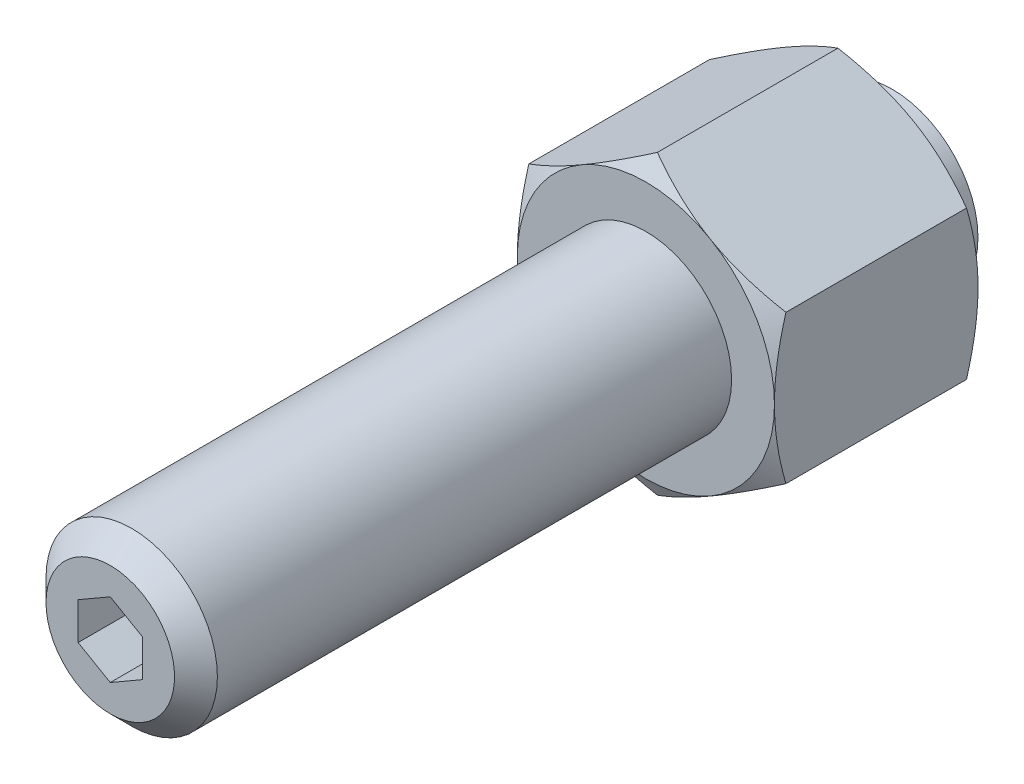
ISO-10303-21;
HEADER;
FILE_DESCRIPTION(('STEP AP214'),'2;1');
FILE_NAME('part.step','',(''),(''),'','','');
FILE_SCHEMA(('AUTOMOTIVE_DESIGN { 1 0 10303 214 1 1 1 1 }'));
ENDSEC;
DATA;
#1=APPLICATION_CONTEXT('core data for automotive mechanical design processes');
#2=APPLICATION_PROTOCOL_DEFINITION('international standard','automotive_design',2000,#1);
#3=PRODUCT_CONTEXT('',#1,'mechanical');
#4=PRODUCT('Part','Part','',(#3));
#5=PRODUCT_RELATED_PRODUCT_CATEGORY('part','',(#4));
#6=PRODUCT_DEFINITION_FORMATION('','',#4);
#7=PRODUCT_DEFINITION_CONTEXT('part definition',#1,'design');
#8=PRODUCT_DEFINITION('design','',#6,#7);
#9=PRODUCT_DEFINITION_SHAPE('','',#8);
#10=(LENGTH_UNIT() NAMED_UNIT(*) SI_UNIT(.MILLI.,.METRE.));
#11=(NAMED_UNIT(*) PLANE_ANGLE_UNIT() SI_UNIT($,.RADIAN.));
#12=(NAMED_UNIT(*) SI_UNIT($,.STERADIAN.) SOLID_ANGLE_UNIT());
#13=UNCERTAINTY_MEASURE_WITH_UNIT(LENGTH_MEASURE(1.E-05),#10,'distance_accuracy_value','');
#14=(GEOMETRIC_REPRESENTATION_CONTEXT(3) GLOBAL_UNCERTAINTY_ASSIGNED_CONTEXT((#13)) GLOBAL_UNIT_ASSIGNED_CONTEXT((#10,
#11,#12)) REPRESENTATION_CONTEXT('',''));
#15=CARTESIAN_POINT('',(0.,0.,0.));
#16=DIRECTION('',(0.,0.,1.));
#17=DIRECTION('',(1.,0.,0.));
#18=AXIS2_PLACEMENT_3D('',#15,#16,#17);
#19=CARTESIAN_POINT('',(0.,-13.8564064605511,53.));
#20=DIRECTION('',(-0.5,-0.866025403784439,0.));
#21=DIRECTION('',(-0.866025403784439,0.5,0.));
#22=AXIS2_PLACEMENT_3D('',#19,#20,#21);
#23=PLANE('',#22);
#24=DIRECTION('',(0.,0.,-1.));
#25=VECTOR('',#24,1.);
#26=CARTESIAN_POINT('',(-12.,-6.92820323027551,53.));
#27=LINE('',#26,#25);
#28=CARTESIAN_POINT('',(-12.,-6.92820323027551,21.9282032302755));
#29=VERTEX_POINT('',#28);
#30=CARTESIAN_POINT('',(-12.,-6.92820323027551,5.07179676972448));
#31=VERTEX_POINT('',#30);
#32=EDGE_CURVE('E170',#29,#31,#27,.T.);
#33=ORIENTED_EDGE('',*,*,#32,.T.);
#34=CARTESIAN_POINT('',(-12.0002,-6.92808776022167,5.07186343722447));
#35=CARTESIAN_POINT('',(-11.7364142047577,-7.08038456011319,4.98394963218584));
#36=CARTESIAN_POINT('',(-11.4716448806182,-7.23324920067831,4.90002599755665));
#37=CARTESIAN_POINT('',(-10.9399829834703,-7.54020434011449,4.74126621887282));
#38=CARTESIAN_POINT('',(-10.6730897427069,-7.69429522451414,4.66643306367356));
#39=CARTESIAN_POINT('',(-9.86810959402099,-8.15905073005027,4.45701753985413));
#40=CARTESIAN_POINT('',(-9.3268449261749,-8.47155003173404,4.33790323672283));
#41=CARTESIAN_POINT('',(-8.51686717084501,-8.93919090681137,4.19823106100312));
#42=CARTESIAN_POINT('',(-8.25057389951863,-9.09293539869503,4.15844379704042));
#43=CARTESIAN_POINT('',(-7.71675440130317,-9.40113622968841,4.09172336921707));
#44=CARTESIAN_POINT('',(-7.44922815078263,-9.55559258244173,4.06479045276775));
#45=CARTESIAN_POINT('',(-6.91372963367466,-9.86476279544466,4.0244685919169));
#46=CARTESIAN_POINT('',(-6.64575827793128,-10.0194761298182,4.01106355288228));
#47=CARTESIAN_POINT('',(-6.10956726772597,-10.3290461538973,3.99808309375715));
#48=CARTESIAN_POINT('',(-5.84134762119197,-10.4839028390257,3.99850724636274));
#49=CARTESIAN_POINT('',(-5.3399106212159,-10.7734076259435,4.01222001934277));
#50=CARTESIAN_POINT('',(-5.10665750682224,-10.908076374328,4.02383598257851));
#51=CARTESIAN_POINT('',(-4.64068775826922,-11.1771041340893,4.05730800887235));
#52=CARTESIAN_POINT('',(-4.40797116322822,-11.3114631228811,4.07916479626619));
#53=CARTESIAN_POINT('',(-3.94320092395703,-11.5797983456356,4.13273741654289));
#54=CARTESIAN_POINT('',(-3.71114798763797,-11.7137741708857,4.16446139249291));
#55=CARTESIAN_POINT('',(-3.24813003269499,-11.9810977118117,4.23721177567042));
#56=CARTESIAN_POINT('',(-3.01716508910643,-12.1144453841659,4.27823881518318));
#57=CARTESIAN_POINT('',(-2.31605804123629,-12.5192297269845,4.41631165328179));
#58=CARTESIAN_POINT('',(-1.84794625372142,-12.789494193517,4.52712488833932));
#59=CARTESIAN_POINT('',(-0.918702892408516,-13.3259930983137,4.77862576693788));
#60=CARTESIAN_POINT('',(-0.457559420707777,-13.5922344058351,4.91925434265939));
#61=CARTESIAN_POINT('',(0.000200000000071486,-13.8565219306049,5.07186343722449));
#62=B_SPLINE_CURVE_WITH_KNOTS('',3,(#34,#35,#36,#37,#38,#39,#40,#41,#42,#43,#44,#45,#46,#47,#48,
#49,#50,#51,#52,#53,#54,#55,#56,#57,#58,#59,#60,#61),.UNSPECIFIED.,.F.,.F.,(4,2,2,2,2,2,2,2,2,2,
2,2,2,4),(0.,0.951004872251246,1.90232158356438,3.80900466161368,4.7389455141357,
5.66890426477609,6.59775529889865,7.5265776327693,8.3351464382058,9.14377244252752,
9.95306755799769,10.7624176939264,12.4167102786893,14.0677556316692),.UNSPECIFIED.);
#63=CARTESIAN_POINT('',(-6.,-10.3923048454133,4.));
#64=VERTEX_POINT('',#63);
#65=EDGE_CURVE('E149',#31,#64,#62,.T.);
#66=ORIENTED_EDGE('',*,*,#65,.T.);
#67=CARTESIAN_POINT('',(0.,-13.8564064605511,5.0717967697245));
#68=VERTEX_POINT('',#67);
#69=EDGE_CURVE('E160',#64,#68,#62,.T.);
#70=ORIENTED_EDGE('',*,*,#69,.T.);
#71=DIRECTION('',(0.,0.,-1.));
#72=VECTOR('',#71,1.);
#73=CARTESIAN_POINT('',(0.,-13.8564064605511,53.));
#74=LINE('',#73,#72);
#75=CARTESIAN_POINT('',(0.,-13.8564064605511,21.9282032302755));
#76=VERTEX_POINT('',#75);
#77=EDGE_CURVE('E349',#76,#68,#74,.T.);
#78=ORIENTED_EDGE('',*,*,#77,.F.);
#79=CARTESIAN_POINT('',(0.000200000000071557,-13.8565219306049,21.9281365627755));
#80=CARTESIAN_POINT('',(-0.26358579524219,-13.7042251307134,22.0160503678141));
#81=CARTESIAN_POINT('',(-0.528355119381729,-13.5513604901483,22.0999740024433));
#82=CARTESIAN_POINT('',(-1.06001701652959,-13.2444053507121,22.2587337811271));
#83=CARTESIAN_POINT('',(-1.326910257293,-13.0903144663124,22.3335669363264));
#84=CARTESIAN_POINT('',(-2.13189040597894,-12.6255589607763,22.5429824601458));
#85=CARTESIAN_POINT('',(-2.67315507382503,-12.3130596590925,22.6620967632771));
#86=CARTESIAN_POINT('',(-3.48313282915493,-11.8454187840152,22.8017689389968));
#87=CARTESIAN_POINT('',(-3.74942610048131,-11.6916742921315,22.8415562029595));
#88=CARTESIAN_POINT('',(-4.28324559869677,-11.3834734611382,22.9082766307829));
#89=CARTESIAN_POINT('',(-4.55077184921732,-11.2290171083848,22.9352095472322));
#90=CARTESIAN_POINT('',(-5.08627036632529,-10.9198468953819,22.9755314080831));
#91=CARTESIAN_POINT('',(-5.35424172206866,-10.7651335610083,22.9889364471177));
#92=CARTESIAN_POINT('',(-5.89043273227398,-10.4555635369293,23.0019169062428));
#93=CARTESIAN_POINT('',(-6.15865237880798,-10.3007068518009,23.0014927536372));
#94=CARTESIAN_POINT('',(-6.66008937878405,-10.0112020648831,22.9877799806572));
#95=CARTESIAN_POINT('',(-6.8933424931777,-9.87653331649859,22.9761640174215));
#96=CARTESIAN_POINT('',(-7.35931224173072,-9.60750555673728,22.9426919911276));
#97=CARTESIAN_POINT('',(-7.59202883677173,-9.47314656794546,22.9208352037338));
#98=CARTESIAN_POINT('',(-8.05679907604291,-9.20481134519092,22.8672625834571));
#99=CARTESIAN_POINT('',(-8.28885201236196,-9.07083551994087,22.8355386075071));
#100=CARTESIAN_POINT('',(-8.75186996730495,-8.80351197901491,22.7627882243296));
#101=CARTESIAN_POINT('',(-8.98283491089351,-8.67016430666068,22.7217611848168));
#102=CARTESIAN_POINT('',(-9.68394195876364,-8.26537996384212,22.5836883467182));
#103=CARTESIAN_POINT('',(-10.1520537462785,-7.99511549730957,22.4728751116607));
#104=CARTESIAN_POINT('',(-11.0812971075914,-7.4586165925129,22.2213742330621));
#105=CARTESIAN_POINT('',(-11.5424405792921,-7.19237528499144,22.0807456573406));
#106=CARTESIAN_POINT('',(-12.0002,-6.92808776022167,21.9281365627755));
#107=B_SPLINE_CURVE_WITH_KNOTS('',3,(#79,#80,#81,#82,#83,#84,#85,#86,#87,#88,#89,#90,#91,#92,
#93,#94,#95,#96,#97,#98,#99,#100,#101,#102,#103,#104,#105,#106),.UNSPECIFIED.,.F.,.F.,(4,2,2,2,
2,2,2,2,2,2,2,2,2,4),(0.,0.951004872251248,1.90232158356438,3.80900466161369,4.73894551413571,
5.6689042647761,6.59775529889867,7.52657763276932,8.33514643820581,9.14377244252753,
9.9530675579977,10.7624176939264,12.4167102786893,14.0677556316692),.UNSPECIFIED.);
#108=CARTESIAN_POINT('',(-6.,-10.3923048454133,23.));
#109=VERTEX_POINT('',#108);
#110=EDGE_CURVE('E347',#76,#109,#107,.T.);
#111=ORIENTED_EDGE('',*,*,#110,.T.);
#112=EDGE_CURVE('E235',#109,#29,#107,.T.);
#113=ORIENTED_EDGE('',*,*,#112,.T.);
#114=EDGE_LOOP('',(#33,#66,#70,#78,#111,#113));
#115=FACE_BOUND('',#114,.T.);
#116=ADVANCED_FACE('F14',(#115),#23,.T.);
#117=CARTESIAN_POINT('',(-12.,-6.92820323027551,53.));
#118=DIRECTION('',(-1.,0.,0.));
#119=DIRECTION('',(0.,1.,0.));
#120=AXIS2_PLACEMENT_3D('',#117,#118,#119);
#121=PLANE('',#120);
#122=DIRECTION('',(0.,0.,-1.));
#123=VECTOR('',#122,1.);
#124=CARTESIAN_POINT('',(-12.,6.92820323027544,53.));
#125=LINE('',#124,#123);
#126=CARTESIAN_POINT('',(-12.,6.92820323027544,21.9282032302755));
#127=VERTEX_POINT('',#126);
#128=CARTESIAN_POINT('',(-12.,6.92820323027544,5.07179676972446));
#129=VERTEX_POINT('',#128);
#130=EDGE_CURVE('E306',#127,#129,#125,.T.);
#131=ORIENTED_EDGE('',*,*,#130,.T.);
#132=CARTESIAN_POINT('',(-12.,-18.6281877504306,9.8651463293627));
#133=CARTESIAN_POINT('',(-12.,-18.3660668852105,9.73792554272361));
#134=CARTESIAN_POINT('',(-12.,-18.1036389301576,9.61133777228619));
#135=CARTESIAN_POINT('',(-12.,-17.5781047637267,9.35957159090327));
#136=CARTESIAN_POINT('',(-12.,-17.3149985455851,9.23439319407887));
#137=CARTESIAN_POINT('',(-12.,-16.5244965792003,8.86115418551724));
#138=CARTESIAN_POINT('',(-12.,-15.9959947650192,8.6154273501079));
#139=CARTESIAN_POINT('',(-12.,-14.9325930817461,8.13036035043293));
#140=CARTESIAN_POINT('',(-12.,-14.3976740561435,7.89106208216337));
#141=CARTESIAN_POINT('',(-12.,-13.3235885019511,7.42222991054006));
#142=CARTESIAN_POINT('',(-12.,-12.7844221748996,7.1926955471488));
#143=CARTESIAN_POINT('',(-12.,-11.6834875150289,6.73875998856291));
#144=CARTESIAN_POINT('',(-12.,-11.1215513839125,6.51476364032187));
#145=CARTESIAN_POINT('',(-12.,-9.99110750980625,6.0836789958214));
#146=CARTESIAN_POINT('',(-12.,-9.42259903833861,5.87659259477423));
#147=CARTESIAN_POINT('',(-12.,-8.27918285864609,5.48475420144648));
#148=CARTESIAN_POINT('',(-12.,-7.70429071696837,5.29995714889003));
#149=CARTESIAN_POINT('',(-12.,-6.54620522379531,4.95860494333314));
#150=CARTESIAN_POINT('',(-12.,-5.96301454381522,4.8020409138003));
#151=CARTESIAN_POINT('',(-12.,-5.08352120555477,4.59445589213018));
#152=CARTESIAN_POINT('',(-12.,-4.79038345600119,4.52994449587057));
#153=CARTESIAN_POINT('',(-12.,-4.20210156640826,4.41077474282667));
#154=CARTESIAN_POINT('',(-12.,-3.90695746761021,4.35611618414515));
#155=CARTESIAN_POINT('',(-12.,-3.31486481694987,4.25761576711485));
#156=CARTESIAN_POINT('',(-12.,-3.01791628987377,4.21377376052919));
#157=CARTESIAN_POINT('',(-12.,-2.42252825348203,4.13778042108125));
#158=CARTESIAN_POINT('',(-12.,-2.12408880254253,4.10562863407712));
#159=CARTESIAN_POINT('',(-12.,-1.53004003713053,4.05405853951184));
#160=CARTESIAN_POINT('',(-12.,-1.23444479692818,4.03447909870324));
#161=CARTESIAN_POINT('',(-12.,-0.642691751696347,4.00783910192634));
#162=CARTESIAN_POINT('',(-12.,-0.346533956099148,4.00077833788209));
#163=CARTESIAN_POINT('',(-12.,0.245815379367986,3.99934367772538));
#164=CARTESIAN_POINT('',(-12.,0.542006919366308,4.00496983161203));
#165=CARTESIAN_POINT('',(-12.,1.13388879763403,4.02877161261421));
#166=CARTESIAN_POINT('',(-12.,1.42957911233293,4.04694781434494));
#167=CARTESIAN_POINT('',(-12.,2.13967398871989,4.10528150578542));
#168=CARTESIAN_POINT('',(-12.,2.5536004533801,4.15136346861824));
#169=CARTESIAN_POINT('',(-12.,3.37839571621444,4.26561530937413));
#170=CARTESIAN_POINT('',(-12.,3.78926409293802,4.33378817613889));
#171=CARTESIAN_POINT('',(-12.,4.60754699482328,4.4897966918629));
#172=CARTESIAN_POINT('',(-12.,5.01495857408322,4.57764764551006));
#173=CARTESIAN_POINT('',(-12.,5.82570176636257,4.77033031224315));
#174=CARTESIAN_POINT('',(-12.,6.22903344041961,4.87516177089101));
#175=CARTESIAN_POINT('',(-12.,7.04047526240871,5.10172790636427));
#176=CARTESIAN_POINT('',(-12.,7.44849504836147,5.22378397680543));
#177=CARTESIAN_POINT('',(-12.,8.26051549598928,5.48053632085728));
#178=CARTESIAN_POINT('',(-12.,8.66451613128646,5.61523267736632));
#179=CARTESIAN_POINT('',(-12.,9.46869720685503,5.89512438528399));
#180=CARTESIAN_POINT('',(-12.,9.86887886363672,6.04031625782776));
#181=CARTESIAN_POINT('',(-12.,10.6659244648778,6.33948803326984));
#182=CARTESIAN_POINT('',(-12.,11.0627884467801,6.49346783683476));
#183=CARTESIAN_POINT('',(-12.,11.9933577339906,6.86449143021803));
#184=CARTESIAN_POINT('',(-12.,12.5258443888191,7.08458698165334));
#185=CARTESIAN_POINT('',(-12.,13.5863250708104,7.53537825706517));
#186=CARTESIAN_POINT('',(-12.,14.114318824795,7.76607462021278));
#187=CARTESIAN_POINT('',(-12.,15.1666416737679,8.23596235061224));
#188=CARTESIAN_POINT('',(-12.,15.6909699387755,8.47515557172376));
#189=CARTESIAN_POINT('',(-12.,16.7364520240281,8.9603370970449));
#190=CARTESIAN_POINT('',(-12.,17.2576059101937,9.20632525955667));
#191=CARTESIAN_POINT('',(-12.,18.2978226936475,9.70410432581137));
#192=CARTESIAN_POINT('',(-12.,18.8168827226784,9.95590121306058));
#193=CARTESIAN_POINT('',(-12.,19.8527654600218,10.4640549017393));
#194=CARTESIAN_POINT('',(-12.,20.3695881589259,10.7204117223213));
#195=CARTESIAN_POINT('',(-12.,21.4012721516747,11.2368761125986));
#196=CARTESIAN_POINT('',(-12.,21.9161336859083,11.4969832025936));
#197=CARTESIAN_POINT('',(-12.,22.9442423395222,12.0203703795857));
#198=CARTESIAN_POINT('',(-12.,23.4574894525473,12.2836504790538));
#199=CARTESIAN_POINT('',(-12.,24.9100281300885,13.0335408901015));
#200=CARTESIAN_POINT('',(-12.,25.847691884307,13.5233042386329));
#201=CARTESIAN_POINT('',(-12.,27.7195134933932,14.5095476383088));
#202=CARTESIAN_POINT('',(-12.,28.6536712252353,15.0060279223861));
#203=CARTESIAN_POINT('',(-12.,30.5169293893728,16.0029060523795));
#204=CARTESIAN_POINT('',(-12.,31.4460366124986,16.5032912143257));
#205=CARTESIAN_POINT('',(-12.,32.838040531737,17.2568657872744));
#206=CARTESIAN_POINT('',(-12.,33.3017532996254,17.508550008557));
#207=CARTESIAN_POINT('',(-12.,34.228688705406,18.0128177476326));
#208=CARTESIAN_POINT('',(-12.,34.6919113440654,18.2654012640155));
#209=CARTESIAN_POINT('',(-12.,35.1549165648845,18.5183828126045));
#210=B_SPLINE_CURVE_WITH_KNOTS('',3,(#132,#133,#134,#135,#136,#137,#138,#139,#140,#141,#142,
#143,#144,#145,#146,#147,#148,#149,#150,#151,#152,#153,#154,#155,#156,#157,#158,#159,#160,#161,
#162,#163,#164,#165,#166,#167,#168,#169,#170,#171,#172,#173,#174,#175,#176,#177,#178,#179,#180,
#181,#182,#183,#184,#185,#186,#187,#188,#189,#190,#191,#192,#193,#194,#195,#196,#197,#198,#199,
#200,#201,#202,#203,#204,#205,#206,#207,#208,#209),.UNSPECIFIED.,.F.,.F.,(4,2,2,2,2,2,2,2,2,2,2,
2,2,2,2,2,2,2,2,2,2,2,2,2,2,2,2,2,2,2,2,2,2,2,2,2,2,2,4),(0.,0.874087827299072,1.74818440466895,
3.4966352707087,5.25457465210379,7.0124311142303,8.82702887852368,10.6418297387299,
12.4528980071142,14.2633958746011,15.1637142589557,16.0640141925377,16.9643017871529,
17.8645544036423,18.7530256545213,19.6414821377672,20.5299421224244,21.4184427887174,
22.6672032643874,23.9161327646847,25.1660370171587,26.4159225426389,27.6933321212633,
28.9707500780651,30.247746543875,31.5247285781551,33.2531152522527,34.9816062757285,
36.7104767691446,38.4393112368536,40.1700139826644,41.9007239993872,43.6312145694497,
45.3617119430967,48.5352701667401,51.7089387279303,54.8747789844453,56.4576144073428,
58.040447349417),.UNSPECIFIED.);
#211=CARTESIAN_POINT('',(-12.,0.,4.));
#212=VERTEX_POINT('',#211);
#213=EDGE_CURVE('E289',#129,#212,#210,.F.);
#214=ORIENTED_EDGE('',*,*,#213,.T.);
#215=EDGE_CURVE('E151',#212,#31,#210,.F.);
#216=ORIENTED_EDGE('',*,*,#215,.T.);
#217=ORIENTED_EDGE('',*,*,#32,.F.);
#218=CARTESIAN_POINT('',(-12.,-18.6281877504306,17.1348536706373));
#219=CARTESIAN_POINT('',(-12.,-18.3660668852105,17.2620744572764));
#220=CARTESIAN_POINT('',(-12.,-18.1036389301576,17.3886622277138));
#221=CARTESIAN_POINT('',(-12.,-17.5781047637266,17.6404284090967));
#222=CARTESIAN_POINT('',(-12.,-17.3149985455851,17.7656068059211));
#223=CARTESIAN_POINT('',(-12.,-16.5244965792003,18.1388458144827));
#224=CARTESIAN_POINT('',(-12.,-15.9959947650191,18.3845726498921));
#225=CARTESIAN_POINT('',(-12.,-14.9325930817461,18.8696396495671));
#226=CARTESIAN_POINT('',(-12.,-14.3976740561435,19.1089379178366));
#227=CARTESIAN_POINT('',(-12.,-13.3235885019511,19.5777700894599));
#228=CARTESIAN_POINT('',(-12.,-12.7844221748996,19.8073044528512));
#229=CARTESIAN_POINT('',(-12.,-11.6834875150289,20.2612400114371));
#230=CARTESIAN_POINT('',(-12.,-11.1215513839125,20.4852363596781));
#231=CARTESIAN_POINT('',(-12.,-9.99110750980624,20.9163210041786));
#232=CARTESIAN_POINT('',(-12.,-9.4225990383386,21.1234074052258));
#233=CARTESIAN_POINT('',(-12.,-8.27918285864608,21.5152457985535));
#234=CARTESIAN_POINT('',(-12.,-7.70429071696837,21.7000428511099));
#235=CARTESIAN_POINT('',(-12.,-6.54620522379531,22.0413950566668));
#236=CARTESIAN_POINT('',(-12.,-5.96301454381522,22.1979590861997));
#237=CARTESIAN_POINT('',(-12.,-5.08352120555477,22.4055441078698));
#238=CARTESIAN_POINT('',(-12.,-4.79038345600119,22.4700555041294));
#239=CARTESIAN_POINT('',(-12.,-4.20210156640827,22.5892252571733));
#240=CARTESIAN_POINT('',(-12.,-3.90695746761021,22.6438838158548));
#241=CARTESIAN_POINT('',(-12.,-3.31486481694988,22.7423842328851));
#242=CARTESIAN_POINT('',(-12.,-3.01791628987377,22.7862262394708));
#243=CARTESIAN_POINT('',(-12.,-2.42252825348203,22.8622195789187));
#244=CARTESIAN_POINT('',(-12.,-2.12408880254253,22.8943713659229));
#245=CARTESIAN_POINT('',(-12.,-1.53004003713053,22.9459414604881));
#246=CARTESIAN_POINT('',(-12.,-1.23444479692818,22.9655209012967));
#247=CARTESIAN_POINT('',(-12.,-0.642691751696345,22.9921608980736));
#248=CARTESIAN_POINT('',(-12.,-0.346533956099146,22.9992216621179));
#249=CARTESIAN_POINT('',(-12.,0.245815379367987,23.0006563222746));
#250=CARTESIAN_POINT('',(-12.,0.542006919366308,22.9950301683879));
#251=CARTESIAN_POINT('',(-12.,1.13388879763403,22.9712283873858));
#252=CARTESIAN_POINT('',(-12.,1.42957911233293,22.953052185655));
#253=CARTESIAN_POINT('',(-12.,2.13967398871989,22.8947184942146));
#254=CARTESIAN_POINT('',(-12.,2.5536004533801,22.8486365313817));
#255=CARTESIAN_POINT('',(-12.,3.37839571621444,22.7343846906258));
#256=CARTESIAN_POINT('',(-12.,3.78926409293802,22.6662118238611));
#257=CARTESIAN_POINT('',(-12.,4.60754699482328,22.5102033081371));
#258=CARTESIAN_POINT('',(-12.,5.01495857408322,22.4223523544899));
#259=CARTESIAN_POINT('',(-12.,5.82570176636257,22.2296696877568));
#260=CARTESIAN_POINT('',(-12.,6.22903344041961,22.124838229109));
#261=CARTESIAN_POINT('',(-12.,7.04047526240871,21.8982720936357));
#262=CARTESIAN_POINT('',(-12.,7.44849504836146,21.7762160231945));
#263=CARTESIAN_POINT('',(-12.,8.26051549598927,21.5194636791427));
#264=CARTESIAN_POINT('',(-12.,8.66451613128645,21.3847673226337));
#265=CARTESIAN_POINT('',(-12.,9.46869720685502,21.104875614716));
#266=CARTESIAN_POINT('',(-12.,9.86887886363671,20.9596837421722));
#267=CARTESIAN_POINT('',(-12.,10.6659244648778,20.6605119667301));
#268=CARTESIAN_POINT('',(-12.,11.0627884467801,20.5065321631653));
#269=CARTESIAN_POINT('',(-12.,11.9933577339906,20.135508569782));
#270=CARTESIAN_POINT('',(-12.,12.5258443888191,19.9154130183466));
#271=CARTESIAN_POINT('',(-12.,13.5863250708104,19.4646217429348));
#272=CARTESIAN_POINT('',(-12.,14.114318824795,19.2339253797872));
#273=CARTESIAN_POINT('',(-12.,15.1666416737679,18.7640376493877));
#274=CARTESIAN_POINT('',(-12.,15.6909699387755,18.5248444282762));
#275=CARTESIAN_POINT('',(-12.,16.7364520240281,18.0396629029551));
#276=CARTESIAN_POINT('',(-12.,17.2576059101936,17.7936747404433));
#277=CARTESIAN_POINT('',(-12.,18.2978226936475,17.2958956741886));
#278=CARTESIAN_POINT('',(-12.,18.8168827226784,17.0440987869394));
#279=CARTESIAN_POINT('',(-12.,19.8527654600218,16.5359450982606));
#280=CARTESIAN_POINT('',(-12.,20.3695881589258,16.2795882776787));
#281=CARTESIAN_POINT('',(-12.,21.4012721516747,15.7631238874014));
#282=CARTESIAN_POINT('',(-12.,21.9161336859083,15.5030167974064));
#283=CARTESIAN_POINT('',(-12.,22.9442423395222,14.9796296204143));
#284=CARTESIAN_POINT('',(-12.,23.4574894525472,14.7163495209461));
#285=CARTESIAN_POINT('',(-12.,24.9100281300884,13.9664591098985));
#286=CARTESIAN_POINT('',(-12.,25.8476918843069,13.4766957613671));
#287=CARTESIAN_POINT('',(-12.,27.7195134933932,12.4904523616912));
#288=CARTESIAN_POINT('',(-12.,28.6536712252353,11.9939720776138));
#289=CARTESIAN_POINT('',(-12.,30.5169293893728,10.9970939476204));
#290=CARTESIAN_POINT('',(-12.,31.4460366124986,10.4967087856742));
#291=CARTESIAN_POINT('',(-12.,32.838040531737,9.74313421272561));
#292=CARTESIAN_POINT('',(-12.,33.3017532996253,9.491449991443));
#293=CARTESIAN_POINT('',(-12.,34.228688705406,8.98718225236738));
#294=CARTESIAN_POINT('',(-12.,34.6919113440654,8.73459873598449));
#295=CARTESIAN_POINT('',(-12.,35.1549165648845,8.48161718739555));
#296=B_SPLINE_CURVE_WITH_KNOTS('',3,(#218,#219,#220,#221,#222,#223,#224,#225,#226,#227,#228,
#229,#230,#231,#232,#233,#234,#235,#236,#237,#238,#239,#240,#241,#242,#243,#244,#245,#246,#247,
#248,#249,#250,#251,#252,#253,#254,#255,#256,#257,#258,#259,#260,#261,#262,#263,#264,#265,#266,
#267,#268,#269,#270,#271,#272,#273,#274,#275,#276,#277,#278,#279,#280,#281,#282,#283,#284,#285,
#286,#287,#288,#289,#290,#291,#292,#293,#294,#295),.UNSPECIFIED.,.F.,.F.,(4,2,2,2,2,2,2,2,2,2,2,
2,2,2,2,2,2,2,2,2,2,2,2,2,2,2,2,2,2,2,2,2,2,2,2,2,2,2,4),(0.,0.874087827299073,1.74818440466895,
3.4966352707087,5.25457465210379,7.0124311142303,8.82702887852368,10.6418297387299,
12.4528980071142,14.2633958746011,15.1637142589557,16.0640141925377,16.9643017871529,
17.8645544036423,18.7530256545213,19.6414821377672,20.5299421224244,21.4184427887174,
22.6672032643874,23.9161327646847,25.1660370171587,26.4159225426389,27.6933321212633,
28.970750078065,30.247746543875,31.5247285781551,33.2531152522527,34.9816062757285,
36.7104767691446,38.4393112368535,40.1700139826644,41.9007239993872,43.6312145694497,
45.3617119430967,48.5352701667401,51.7089387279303,54.8747789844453,56.4576144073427,
58.0404473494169),.UNSPECIFIED.);
#297=CARTESIAN_POINT('',(-12.,0.,23.));
#298=VERTEX_POINT('',#297);
#299=EDGE_CURVE('E245',#29,#298,#296,.T.);
#300=ORIENTED_EDGE('',*,*,#299,.T.);
#301=EDGE_CURVE('E265',#298,#127,#296,.T.);
#302=ORIENTED_EDGE('',*,*,#301,.T.);
#303=EDGE_LOOP('',(#131,#214,#216,#217,#300,#302));
#304=FACE_BOUND('',#303,.T.);
#305=ADVANCED_FACE('F269',(#304),#121,.T.);
#306=CARTESIAN_POINT('',(0.,13.8564064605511,53.));
#307=DIRECTION('',(0.500000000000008,-0.866025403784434,0.));
#308=DIRECTION('',(-0.866025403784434,-0.500000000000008,0.));
#309=AXIS2_PLACEMENT_3D('',#306,#307,#308);
#310=PLANE('',#309);
#311=CARTESIAN_POINT('',(-12.0002,6.9280877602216,5.07186343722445));
#312=CARTESIAN_POINT('',(-11.7364142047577,7.08038456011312,4.98394963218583));
#313=CARTESIAN_POINT('',(-11.4716448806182,7.23324920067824,4.90002599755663));
#314=CARTESIAN_POINT('',(-10.9399829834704,7.54020434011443,4.7412662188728));
#315=CARTESIAN_POINT('',(-10.6730897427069,7.69429522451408,4.66643306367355));
#316=CARTESIAN_POINT('',(-9.86810959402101,8.15905073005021,4.45701753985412));
#317=CARTESIAN_POINT('',(-9.32684492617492,8.47155003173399,4.33790323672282));
#318=CARTESIAN_POINT('',(-8.51686717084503,8.93919090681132,4.19823106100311));
#319=CARTESIAN_POINT('',(-8.25057389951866,9.092935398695,4.15844379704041));
#320=CARTESIAN_POINT('',(-7.7167544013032,9.40113622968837,4.09172336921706));
#321=CARTESIAN_POINT('',(-7.44922815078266,9.5555925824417,4.06479045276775));
#322=CARTESIAN_POINT('',(-6.91372963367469,9.86476279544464,4.0244685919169));
#323=CARTESIAN_POINT('',(-6.64575827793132,10.0194761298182,4.01106355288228));
#324=CARTESIAN_POINT('',(-6.10956726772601,10.3290461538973,3.99808309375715));
#325=CARTESIAN_POINT('',(-5.84134762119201,10.4839028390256,3.99850724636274));
#326=CARTESIAN_POINT('',(-5.33991062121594,10.7734076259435,4.01222001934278));
#327=CARTESIAN_POINT('',(-5.10665750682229,10.908076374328,4.02383598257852));
#328=CARTESIAN_POINT('',(-4.64068775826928,11.1771041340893,4.05730800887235));
#329=CARTESIAN_POINT('',(-4.40797116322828,11.3114631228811,4.0791647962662));
#330=CARTESIAN_POINT('',(-3.9432009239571,11.5797983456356,4.1327374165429));
#331=CARTESIAN_POINT('',(-3.71114798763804,11.7137741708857,4.16446139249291));
#332=CARTESIAN_POINT('',(-3.24813003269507,11.9810977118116,4.23721177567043));
#333=CARTESIAN_POINT('',(-3.01716508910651,12.1144453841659,4.27823881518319));
#334=CARTESIAN_POINT('',(-2.31605804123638,12.5192297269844,4.4163116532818));
#335=CARTESIAN_POINT('',(-1.84794625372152,12.789494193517,4.52712488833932));
#336=CARTESIAN_POINT('',(-0.918702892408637,13.3259930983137,4.77862576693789));
#337=CARTESIAN_POINT('',(-0.457559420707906,13.5922344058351,4.91925434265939));
#338=CARTESIAN_POINT('',(0.000199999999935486,13.8565219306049,5.07186343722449));
#339=B_SPLINE_CURVE_WITH_KNOTS('',3,(#311,#312,#313,#314,#315,#316,#317,#318,#319,#320,#321,
#322,#323,#324,#325,#326,#327,#328,#329,#330,#331,#332,#333,#334,#335,#336,#337,#338),
.UNSPECIFIED.,.F.,.F.,(4,2,2,2,2,2,2,2,2,2,2,2,2,4),(0.,0.951004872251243,1.90232158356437,
3.80900466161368,4.73894551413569,5.66890426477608,6.59775529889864,7.52657763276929,
8.33514643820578,9.14377244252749,9.95306755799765,10.7624176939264,12.4167102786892,
14.0677556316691),.UNSPECIFIED.);
#340=CARTESIAN_POINT('',(-6.0000000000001,10.3923048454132,4.));
#341=VERTEX_POINT('',#340);
#342=EDGE_CURVE('E280',#129,#341,#339,.T.);
#343=ORIENTED_EDGE('',*,*,#342,.F.);
#344=ORIENTED_EDGE('',*,*,#130,.F.);
#345=CARTESIAN_POINT('',(0.000199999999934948,13.8565219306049,21.9281365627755));
#346=CARTESIAN_POINT('',(-0.263585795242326,13.7042251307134,22.0160503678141));
#347=CARTESIAN_POINT('',(-0.528355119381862,13.5513604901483,22.0999740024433));
#348=CARTESIAN_POINT('',(-1.06001701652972,13.2444053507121,22.2587337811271));
#349=CARTESIAN_POINT('',(-1.32691025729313,13.0903144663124,22.3335669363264));
#350=CARTESIAN_POINT('',(-2.13189040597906,12.6255589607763,22.5429824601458));
#351=CARTESIAN_POINT('',(-2.67315507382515,12.3130596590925,22.6620967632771));
#352=CARTESIAN_POINT('',(-3.48313282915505,11.8454187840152,22.8017689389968));
#353=CARTESIAN_POINT('',(-3.74942610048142,11.6916742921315,22.8415562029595));
#354=CARTESIAN_POINT('',(-4.28324559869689,11.3834734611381,22.9082766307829));
#355=CARTESIAN_POINT('',(-4.55077184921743,11.2290171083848,22.9352095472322));
#356=CARTESIAN_POINT('',(-5.0862703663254,10.9198468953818,22.9755314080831));
#357=CARTESIAN_POINT('',(-5.35424172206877,10.7651335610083,22.9889364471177));
#358=CARTESIAN_POINT('',(-5.89043273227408,10.4555635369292,23.0019169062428));
#359=CARTESIAN_POINT('',(-6.15865237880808,10.3007068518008,23.0014927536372));
#360=CARTESIAN_POINT('',(-6.66008937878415,10.011202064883,22.9877799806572));
#361=CARTESIAN_POINT('',(-6.8933424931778,9.87653331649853,22.9761640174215));
#362=CARTESIAN_POINT('',(-7.35931224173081,9.60750555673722,22.9426919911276));
#363=CARTESIAN_POINT('',(-7.59202883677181,9.4731465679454,22.9208352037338));
#364=CARTESIAN_POINT('',(-8.05679907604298,9.20481134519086,22.8672625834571));
#365=CARTESIAN_POINT('',(-8.28885201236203,9.0708355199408,22.8355386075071));
#366=CARTESIAN_POINT('',(-8.75186996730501,8.80351197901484,22.7627882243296));
#367=CARTESIAN_POINT('',(-8.98283491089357,8.67016430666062,22.7217611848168));
#368=CARTESIAN_POINT('',(-9.68394195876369,8.26537996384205,22.5836883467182));
#369=CARTESIAN_POINT('',(-10.1520537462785,7.9951154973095,22.4728751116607));
#370=CARTESIAN_POINT('',(-11.0812971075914,7.45861659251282,22.2213742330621));
#371=CARTESIAN_POINT('',(-11.5424405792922,7.19237528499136,22.0807456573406));
#372=CARTESIAN_POINT('',(-12.0002,6.9280877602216,21.9281365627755));
#373=B_SPLINE_CURVE_WITH_KNOTS('',3,(#345,#346,#347,#348,#349,#350,#351,#352,#353,#354,#355,
#356,#357,#358,#359,#360,#361,#362,#363,#364,#365,#366,#367,#368,#369,#370,#371,#372),
.UNSPECIFIED.,.F.,.F.,(4,2,2,2,2,2,2,2,2,2,2,2,2,4),(0.,0.951004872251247,1.90232158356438,
3.80900466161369,4.73894551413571,5.6689042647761,6.59775529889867,7.52657763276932,
8.3351464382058,9.14377244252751,9.95306755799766,10.7624176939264,12.4167102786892,
14.0677556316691),.UNSPECIFIED.);
#374=CARTESIAN_POINT('',(-6.0000000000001,10.3923048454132,23.));
#375=VERTEX_POINT('',#374);
#376=EDGE_CURVE('E259',#375,#127,#373,.T.);
#377=ORIENTED_EDGE('',*,*,#376,.F.);
#378=CARTESIAN_POINT('',(0.,13.8564064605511,21.9282032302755));
#379=VERTEX_POINT('',#378);
#380=EDGE_CURVE('E264',#379,#375,#373,.T.);
#381=ORIENTED_EDGE('',*,*,#380,.F.);
#382=DIRECTION('',(0.,0.,-1.));
#383=VECTOR('',#382,1.);
#384=CARTESIAN_POINT('',(0.,13.8564064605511,53.));
#385=LINE('',#384,#383);
#386=CARTESIAN_POINT('',(0.,13.8564064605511,5.0717967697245));
#387=VERTEX_POINT('',#386);
#388=EDGE_CURVE('E314',#379,#387,#385,.T.);
#389=ORIENTED_EDGE('',*,*,#388,.T.);
#390=EDGE_CURVE('E274',#341,#387,#339,.T.);
#391=ORIENTED_EDGE('',*,*,#390,.F.);
#392=EDGE_LOOP('',(#343,#344,#377,#381,#389,#391));
#393=FACE_BOUND('',#392,.T.);
#394=ADVANCED_FACE('F266',(#393),#310,.F.);
#395=CARTESIAN_POINT('',(0.,13.8564064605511,53.));
#396=DIRECTION('',(0.5,0.866025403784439,0.));
#397=DIRECTION('',(0.866025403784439,-0.5,0.));
#398=AXIS2_PLACEMENT_3D('',#395,#396,#397);
#399=PLANE('',#398);
#400=DIRECTION('',(0.,0.,-1.));
#401=VECTOR('',#400,1.);
#402=CARTESIAN_POINT('',(12.,6.92820323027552,53.));
#403=LINE('',#402,#401);
#404=CARTESIAN_POINT('',(12.,6.92820323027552,21.9282032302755));
#405=VERTEX_POINT('',#404);
#406=CARTESIAN_POINT('',(12.,6.92820323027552,5.07179676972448));
#407=VERTEX_POINT('',#406);
#408=EDGE_CURVE('E326',#405,#407,#403,.T.);
#409=ORIENTED_EDGE('',*,*,#408,.T.);
#410=CARTESIAN_POINT('',(12.0002,6.92808776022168,5.07186343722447));
#411=CARTESIAN_POINT('',(11.7364142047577,7.0803845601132,4.98394963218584));
#412=CARTESIAN_POINT('',(11.4716448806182,7.23324920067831,4.90002599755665));
#413=CARTESIAN_POINT('',(10.9399829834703,7.5402043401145,4.74126621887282));
#414=CARTESIAN_POINT('',(10.6730897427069,7.69429522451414,4.66643306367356));
#415=CARTESIAN_POINT('',(9.86810959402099,8.15905073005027,4.45701753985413));
#416=CARTESIAN_POINT('',(9.3268449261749,8.47155003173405,4.33790323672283));
#417=CARTESIAN_POINT('',(8.51686717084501,8.93919090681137,4.19823106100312));
#418=CARTESIAN_POINT('',(8.25057389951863,9.09293539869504,4.15844379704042));
#419=CARTESIAN_POINT('',(7.71675440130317,9.40113622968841,4.09172336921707));
#420=CARTESIAN_POINT('',(7.44922815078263,9.55559258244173,4.06479045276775));
#421=CARTESIAN_POINT('',(6.91372963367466,9.86476279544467,4.0244685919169));
#422=CARTESIAN_POINT('',(6.64575827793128,10.0194761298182,4.01106355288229));
#423=CARTESIAN_POINT('',(6.10956726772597,10.3290461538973,3.99808309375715));
#424=CARTESIAN_POINT('',(5.84134762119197,10.4839028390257,3.99850724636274));
#425=CARTESIAN_POINT('',(5.3399106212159,10.7734076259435,4.01222001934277));
#426=CARTESIAN_POINT('',(5.10665750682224,10.908076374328,4.02383598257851));
#427=CARTESIAN_POINT('',(4.64068775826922,11.1771041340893,4.05730800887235));
#428=CARTESIAN_POINT('',(4.40797116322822,11.3114631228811,4.0791647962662));
#429=CARTESIAN_POINT('',(3.94320092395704,11.5797983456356,4.13273741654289));
#430=CARTESIAN_POINT('',(3.71114798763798,11.7137741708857,4.16446139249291));
#431=CARTESIAN_POINT('',(3.24813003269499,11.9810977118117,4.23721177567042));
#432=CARTESIAN_POINT('',(3.01716508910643,12.1144453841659,4.27823881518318));
#433=CARTESIAN_POINT('',(2.31605804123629,12.5192297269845,4.41631165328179));
#434=CARTESIAN_POINT('',(1.84794625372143,12.789494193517,4.52712488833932));
#435=CARTESIAN_POINT('',(0.91870289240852,13.3259930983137,4.77862576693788));
#436=CARTESIAN_POINT('',(0.457559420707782,13.5922344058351,4.91925434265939));
#437=CARTESIAN_POINT('',(-0.000200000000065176,13.8565219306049,5.07186343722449));
#438=B_SPLINE_CURVE_WITH_KNOTS('',3,(#410,#411,#412,#413,#414,#415,#416,#417,#418,#419,#420,
#421,#422,#423,#424,#425,#426,#427,#428,#429,#430,#431,#432,#433,#434,#435,#436,#437),
.UNSPECIFIED.,.F.,.F.,(4,2,2,2,2,2,2,2,2,2,2,2,2,4),(0.,0.951004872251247,1.90232158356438,
3.80900466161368,4.7389455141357,5.66890426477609,6.59775529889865,7.5265776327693,
8.33514643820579,9.14377244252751,9.95306755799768,10.7624176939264,12.4167102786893,
14.0677556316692),.UNSPECIFIED.);
#439=CARTESIAN_POINT('',(6.,10.3923048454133,4.));
#440=VERTEX_POINT('',#439);
#441=EDGE_CURVE('E165',#407,#440,#438,.T.);
#442=ORIENTED_EDGE('',*,*,#441,.T.);
#443=EDGE_CURVE('E171',#440,#387,#438,.T.);
#444=ORIENTED_EDGE('',*,*,#443,.T.);
#445=ORIENTED_EDGE('',*,*,#388,.F.);
#446=CARTESIAN_POINT('',(-0.000200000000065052,13.8565219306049,21.9281365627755));
#447=CARTESIAN_POINT('',(0.263585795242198,13.7042251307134,22.0160503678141));
#448=CARTESIAN_POINT('',(0.528355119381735,13.5513604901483,22.0999740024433));
#449=CARTESIAN_POINT('',(1.0600170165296,13.2444053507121,22.2587337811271));
#450=CARTESIAN_POINT('',(1.32691025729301,13.0903144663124,22.3335669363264));
#451=CARTESIAN_POINT('',(2.13189040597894,12.6255589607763,22.5429824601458));
#452=CARTESIAN_POINT('',(2.67315507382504,12.3130596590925,22.6620967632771));
#453=CARTESIAN_POINT('',(3.48313282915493,11.8454187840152,22.8017689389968));
#454=CARTESIAN_POINT('',(3.74942610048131,11.6916742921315,22.8415562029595));
#455=CARTESIAN_POINT('',(4.28324559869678,11.3834734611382,22.9082766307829));
#456=CARTESIAN_POINT('',(4.55077184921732,11.2290171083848,22.9352095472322));
#457=CARTESIAN_POINT('',(5.08627036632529,10.9198468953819,22.9755314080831));
#458=CARTESIAN_POINT('',(5.35424172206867,10.7651335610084,22.9889364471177));
#459=CARTESIAN_POINT('',(5.89043273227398,10.4555635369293,23.0019169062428));
#460=CARTESIAN_POINT('',(6.15865237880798,10.3007068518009,23.0014927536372));
#461=CARTESIAN_POINT('',(6.66008937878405,10.0112020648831,22.9877799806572));
#462=CARTESIAN_POINT('',(6.8933424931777,9.87653331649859,22.9761640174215));
#463=CARTESIAN_POINT('',(7.35931224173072,9.60750555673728,22.9426919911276));
#464=CARTESIAN_POINT('',(7.59202883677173,9.47314656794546,22.9208352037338));
#465=CARTESIAN_POINT('',(8.05679907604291,9.20481134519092,22.8672625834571));
#466=CARTESIAN_POINT('',(8.28885201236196,9.07083551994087,22.8355386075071));
#467=CARTESIAN_POINT('',(8.75186996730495,8.80351197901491,22.7627882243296));
#468=CARTESIAN_POINT('',(8.98283491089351,8.67016430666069,22.7217611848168));
#469=CARTESIAN_POINT('',(9.68394195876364,8.26537996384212,22.5836883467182));
#470=CARTESIAN_POINT('',(10.1520537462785,7.99511549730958,22.4728751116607));
#471=CARTESIAN_POINT('',(11.0812971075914,7.4586165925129,22.2213742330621));
#472=CARTESIAN_POINT('',(11.5424405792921,7.19237528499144,22.0807456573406));
#473=CARTESIAN_POINT('',(12.0002,6.92808776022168,21.9281365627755));
#474=B_SPLINE_CURVE_WITH_KNOTS('',3,(#446,#447,#448,#449,#450,#451,#452,#453,#454,#455,#456,
#457,#458,#459,#460,#461,#462,#463,#464,#465,#466,#467,#468,#469,#470,#471,#472,#473),
.UNSPECIFIED.,.F.,.F.,(4,2,2,2,2,2,2,2,2,2,2,2,2,4),(0.,0.951004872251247,1.90232158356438,
3.80900466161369,4.73894551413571,5.6689042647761,6.59775529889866,7.52657763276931,
8.33514643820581,9.14377244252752,9.95306755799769,10.7624176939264,12.4167102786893,
14.0677556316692),.UNSPECIFIED.);
#475=CARTESIAN_POINT('',(6.,10.3923048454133,23.));
#476=VERTEX_POINT('',#475);
#477=EDGE_CURVE('E215',#379,#476,#474,.T.);
#478=ORIENTED_EDGE('',*,*,#477,.T.);
#479=EDGE_CURVE('E214',#476,#405,#474,.T.);
#480=ORIENTED_EDGE('',*,*,#479,.T.);
#481=EDGE_LOOP('',(#409,#442,#444,#445,#478,#480));
#482=FACE_BOUND('',#481,.T.);
#483=ADVANCED_FACE('F199',(#482),#399,.T.);
#484=CARTESIAN_POINT('',(12.,-6.92820323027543,53.));
#485=DIRECTION('',(-1.,0.,0.));
#486=DIRECTION('',(0.,0.,-1.));
#487=AXIS2_PLACEMENT_3D('',#484,#485,#486);
#488=PLANE('',#487);
#489=CARTESIAN_POINT('',(12.,-18.6281877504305,9.86514632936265));
#490=CARTESIAN_POINT('',(12.,-18.3660668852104,9.73792554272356));
#491=CARTESIAN_POINT('',(12.,-18.1036389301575,9.61133777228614));
#492=CARTESIAN_POINT('',(12.,-17.5781047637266,9.35957159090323));
#493=CARTESIAN_POINT('',(12.,-17.314998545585,9.23439319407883));
#494=CARTESIAN_POINT('',(12.,-16.5244965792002,8.8611541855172));
#495=CARTESIAN_POINT('',(12.,-15.9959947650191,8.61542735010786));
#496=CARTESIAN_POINT('',(12.,-14.932593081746,8.13036035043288));
#497=CARTESIAN_POINT('',(12.,-14.3976740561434,7.89106208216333));
#498=CARTESIAN_POINT('',(12.,-13.323588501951,7.42222991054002));
#499=CARTESIAN_POINT('',(12.,-12.7844221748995,7.19269554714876));
#500=CARTESIAN_POINT('',(12.,-11.6834875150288,6.73875998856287));
#501=CARTESIAN_POINT('',(12.,-11.1215513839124,6.51476364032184));
#502=CARTESIAN_POINT('',(12.,-9.99110750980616,6.08367899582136));
#503=CARTESIAN_POINT('',(12.,-9.42259903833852,5.87659259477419));
#504=CARTESIAN_POINT('',(12.,-8.279182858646,5.48475420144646));
#505=CARTESIAN_POINT('',(12.,-7.70429071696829,5.29995714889));
#506=CARTESIAN_POINT('',(12.,-6.54620522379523,4.95860494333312));
#507=CARTESIAN_POINT('',(12.,-5.96301454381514,4.80204091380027));
#508=CARTESIAN_POINT('',(12.,-5.08352120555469,4.59445589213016));
#509=CARTESIAN_POINT('',(12.,-4.79038345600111,4.52994449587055));
#510=CARTESIAN_POINT('',(12.,-4.20210156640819,4.41077474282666));
#511=CARTESIAN_POINT('',(12.,-3.90695746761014,4.35611618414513));
#512=CARTESIAN_POINT('',(12.,-3.3148648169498,4.25761576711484));
#513=CARTESIAN_POINT('',(12.,-3.0179162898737,4.21377376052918));
#514=CARTESIAN_POINT('',(12.,-2.42252825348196,4.13778042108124));
#515=CARTESIAN_POINT('',(12.,-2.12408880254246,4.10562863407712));
#516=CARTESIAN_POINT('',(12.,-1.53004003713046,4.05405853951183));
#517=CARTESIAN_POINT('',(12.,-1.23444479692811,4.03447909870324));
#518=CARTESIAN_POINT('',(12.,-0.642691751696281,4.00783910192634));
#519=CARTESIAN_POINT('',(12.,-0.346533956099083,4.00077833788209));
#520=CARTESIAN_POINT('',(12.,0.245815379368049,3.99934367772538));
#521=CARTESIAN_POINT('',(12.,0.542006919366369,4.00496983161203));
#522=CARTESIAN_POINT('',(12.,1.13388879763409,4.02877161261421));
#523=CARTESIAN_POINT('',(12.,1.42957911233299,4.04694781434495));
#524=CARTESIAN_POINT('',(12.,2.13967398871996,4.10528150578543));
#525=CARTESIAN_POINT('',(12.,2.55360045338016,4.15136346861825));
#526=CARTESIAN_POINT('',(12.,3.37839571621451,4.26561530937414));
#527=CARTESIAN_POINT('',(12.,3.78926409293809,4.3337881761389));
#528=CARTESIAN_POINT('',(12.,4.60754699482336,4.48979669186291));
#529=CARTESIAN_POINT('',(12.,5.0149585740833,4.57764764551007));
#530=CARTESIAN_POINT('',(12.,5.82570176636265,4.77033031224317));
#531=CARTESIAN_POINT('',(12.,6.22903344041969,4.87516177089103));
#532=CARTESIAN_POINT('',(12.,7.0404752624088,5.10172790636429));
#533=CARTESIAN_POINT('',(12.,7.44849504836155,5.22378397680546));
#534=CARTESIAN_POINT('',(12.,8.26051549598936,5.48053632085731));
#535=CARTESIAN_POINT('',(12.,8.66451613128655,5.61523267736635));
#536=CARTESIAN_POINT('',(12.,9.46869720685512,5.89512438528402));
#537=CARTESIAN_POINT('',(12.,9.86887886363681,6.04031625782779));
#538=CARTESIAN_POINT('',(12.,10.6659244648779,6.33948803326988));
#539=CARTESIAN_POINT('',(12.,11.0627884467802,6.49346783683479));
#540=CARTESIAN_POINT('',(12.,11.9933577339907,6.86449143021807));
#541=CARTESIAN_POINT('',(12.,12.5258443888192,7.08458698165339));
#542=CARTESIAN_POINT('',(12.,13.5863250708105,7.53537825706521));
#543=CARTESIAN_POINT('',(12.,14.1143188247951,7.76607462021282));
#544=CARTESIAN_POINT('',(12.,15.166641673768,8.23596235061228));
#545=CARTESIAN_POINT('',(12.,15.6909699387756,8.4751555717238));
#546=CARTESIAN_POINT('',(12.,16.7364520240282,8.96033709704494));
#547=CARTESIAN_POINT('',(12.,17.2576059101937,9.20632525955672));
#548=CARTESIAN_POINT('',(12.,18.2978226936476,9.70410432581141));
#549=CARTESIAN_POINT('',(12.,18.8168827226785,9.95590121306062));
#550=CARTESIAN_POINT('',(12.,19.8527654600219,10.4640549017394));
#551=CARTESIAN_POINT('',(12.,20.369588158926,10.7204117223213));
#552=CARTESIAN_POINT('',(12.,21.4012721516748,11.2368761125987));
#553=CARTESIAN_POINT('',(12.,21.9161336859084,11.4969832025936));
#554=CARTESIAN_POINT('',(12.,22.9442423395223,12.0203703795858));
#555=CARTESIAN_POINT('',(12.,23.4574894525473,12.2836504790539));
#556=CARTESIAN_POINT('',(12.,24.9100281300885,13.0335408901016));
#557=CARTESIAN_POINT('',(12.,25.847691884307,13.5233042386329));
#558=CARTESIAN_POINT('',(12.,27.7195134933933,14.5095476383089));
#559=CARTESIAN_POINT('',(12.,28.6536712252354,15.0060279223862));
#560=CARTESIAN_POINT('',(12.,30.5169293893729,16.0029060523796));
#561=CARTESIAN_POINT('',(12.,31.4460366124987,16.5032912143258));
#562=CARTESIAN_POINT('',(12.,32.8380405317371,17.2568657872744));
#563=CARTESIAN_POINT('',(12.,33.3017532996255,17.508550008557));
#564=CARTESIAN_POINT('',(12.,34.2286887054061,18.0128177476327));
#565=CARTESIAN_POINT('',(12.,34.6919113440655,18.2654012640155));
#566=CARTESIAN_POINT('',(12.,35.1549165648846,18.5183828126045));
#567=B_SPLINE_CURVE_WITH_KNOTS('',3,(#489,#490,#491,#492,#493,#494,#495,#496,#497,#498,#499,
#500,#501,#502,#503,#504,#505,#506,#507,#508,#509,#510,#511,#512,#513,#514,#515,#516,#517,#518,
#519,#520,#521,#522,#523,#524,#525,#526,#527,#528,#529,#530,#531,#532,#533,#534,#535,#536,#537,
#538,#539,#540,#541,#542,#543,#544,#545,#546,#547,#548,#549,#550,#551,#552,#553,#554,#555,#556,
#557,#558,#559,#560,#561,#562,#563,#564,#565,#566),.UNSPECIFIED.,.F.,.F.,(4,2,2,2,2,2,2,2,2,2,2,
2,2,2,2,2,2,2,2,2,2,2,2,2,2,2,2,2,2,2,2,2,2,2,2,2,2,2,4),(0.,0.874087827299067,1.74818440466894,
3.4966352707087,5.25457465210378,7.01243111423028,8.82702887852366,10.6418297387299,
12.4528980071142,14.2633958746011,15.1637142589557,16.0640141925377,16.9643017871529,
17.8645544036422,18.7530256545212,19.6414821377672,20.5299421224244,21.4184427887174,
22.6672032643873,23.9161327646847,25.1660370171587,26.4159225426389,27.6933321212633,
28.9707500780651,30.247746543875,31.5247285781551,33.2531152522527,34.9816062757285,
36.7104767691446,38.4393112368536,40.1700139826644,41.9007239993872,43.6312145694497,
45.3617119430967,48.5352701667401,51.7089387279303,54.8747789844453,56.4576144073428,
58.040447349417),.UNSPECIFIED.);
#568=CARTESIAN_POINT('',(12.,0.,4.));
#569=VERTEX_POINT('',#568);
#570=EDGE_CURVE('E185',#407,#569,#567,.F.);
#571=ORIENTED_EDGE('',*,*,#570,.F.);
#572=ORIENTED_EDGE('',*,*,#408,.F.);
#573=CARTESIAN_POINT('',(12.,-18.6281877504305,17.1348536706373));
#574=CARTESIAN_POINT('',(12.,-18.3660668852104,17.2620744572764));
#575=CARTESIAN_POINT('',(12.,-18.1036389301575,17.3886622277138));
#576=CARTESIAN_POINT('',(12.,-17.5781047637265,17.6404284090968));
#577=CARTESIAN_POINT('',(12.,-17.314998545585,17.7656068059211));
#578=CARTESIAN_POINT('',(12.,-16.5244965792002,18.1388458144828));
#579=CARTESIAN_POINT('',(12.,-15.995994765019,18.3845726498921));
#580=CARTESIAN_POINT('',(12.,-14.932593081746,18.8696396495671));
#581=CARTESIAN_POINT('',(12.,-14.3976740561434,19.1089379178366));
#582=CARTESIAN_POINT('',(12.,-13.323588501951,19.57777008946));
#583=CARTESIAN_POINT('',(12.,-12.7844221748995,19.8073044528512));
#584=CARTESIAN_POINT('',(12.,-11.6834875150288,20.2612400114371));
#585=CARTESIAN_POINT('',(12.,-11.1215513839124,20.4852363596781));
#586=CARTESIAN_POINT('',(12.,-9.99110750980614,20.9163210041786));
#587=CARTESIAN_POINT('',(12.,-9.4225990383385,21.1234074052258));
#588=CARTESIAN_POINT('',(12.,-8.27918285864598,21.5152457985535));
#589=CARTESIAN_POINT('',(12.,-7.70429071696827,21.70004285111));
#590=CARTESIAN_POINT('',(12.,-6.54620522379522,22.0413950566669));
#591=CARTESIAN_POINT('',(12.,-5.96301454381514,22.1979590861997));
#592=CARTESIAN_POINT('',(12.,-5.08352120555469,22.4055441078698));
#593=CARTESIAN_POINT('',(12.,-4.79038345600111,22.4700555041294));
#594=CARTESIAN_POINT('',(12.,-4.20210156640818,22.5892252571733));
#595=CARTESIAN_POINT('',(12.,-3.90695746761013,22.6438838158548));
#596=CARTESIAN_POINT('',(12.,-3.3148648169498,22.7423842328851));
#597=CARTESIAN_POINT('',(12.,-3.01791628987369,22.7862262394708));
#598=CARTESIAN_POINT('',(12.,-2.42252825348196,22.8622195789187));
#599=CARTESIAN_POINT('',(12.,-2.12408880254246,22.8943713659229));
#600=CARTESIAN_POINT('',(12.,-1.53004003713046,22.9459414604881));
#601=CARTESIAN_POINT('',(12.,-1.23444479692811,22.9655209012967));
#602=CARTESIAN_POINT('',(12.,-0.642691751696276,22.9921608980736));
#603=CARTESIAN_POINT('',(12.,-0.346533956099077,22.9992216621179));
#604=CARTESIAN_POINT('',(12.,0.245815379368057,23.0006563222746));
#605=CARTESIAN_POINT('',(12.,0.542006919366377,22.9950301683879));
#606=CARTESIAN_POINT('',(12.,1.1338887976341,22.9712283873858));
#607=CARTESIAN_POINT('',(12.,1.429579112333,22.953052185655));
#608=CARTESIAN_POINT('',(12.,2.13967398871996,22.8947184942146));
#609=CARTESIAN_POINT('',(12.,2.55360045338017,22.8486365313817));
#610=CARTESIAN_POINT('',(12.,3.37839571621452,22.7343846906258));
#611=CARTESIAN_POINT('',(12.,3.7892640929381,22.6662118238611));
#612=CARTESIAN_POINT('',(12.,4.60754699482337,22.5102033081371));
#613=CARTESIAN_POINT('',(12.,5.01495857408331,22.4223523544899));
#614=CARTESIAN_POINT('',(12.,5.82570176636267,22.2296696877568));
#615=CARTESIAN_POINT('',(12.,6.22903344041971,22.1248382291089));
#616=CARTESIAN_POINT('',(12.,7.04047526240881,21.8982720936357));
#617=CARTESIAN_POINT('',(12.,7.44849504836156,21.7762160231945));
#618=CARTESIAN_POINT('',(12.,8.26051549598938,21.5194636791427));
#619=CARTESIAN_POINT('',(12.,8.66451613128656,21.3847673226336));
#620=CARTESIAN_POINT('',(12.,9.46869720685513,21.104875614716));
#621=CARTESIAN_POINT('',(12.,9.86887886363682,20.9596837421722));
#622=CARTESIAN_POINT('',(12.,10.6659244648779,20.6605119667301));
#623=CARTESIAN_POINT('',(12.,11.0627884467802,20.5065321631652));
#624=CARTESIAN_POINT('',(12.,11.9933577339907,20.1355085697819));
#625=CARTESIAN_POINT('',(12.,12.5258443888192,19.9154130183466));
#626=CARTESIAN_POINT('',(12.,13.5863250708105,19.4646217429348));
#627=CARTESIAN_POINT('',(12.,14.1143188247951,19.2339253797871));
#628=CARTESIAN_POINT('',(12.,15.166641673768,18.7640376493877));
#629=CARTESIAN_POINT('',(12.,15.6909699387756,18.5248444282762));
#630=CARTESIAN_POINT('',(12.,16.7364520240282,18.039662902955));
#631=CARTESIAN_POINT('',(12.,17.2576059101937,17.7936747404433));
#632=CARTESIAN_POINT('',(12.,18.2978226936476,17.2958956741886));
#633=CARTESIAN_POINT('',(12.,18.8168827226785,17.0440987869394));
#634=CARTESIAN_POINT('',(12.,19.8527654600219,16.5359450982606));
#635=CARTESIAN_POINT('',(12.,20.3695881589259,16.2795882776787));
#636=CARTESIAN_POINT('',(12.,21.4012721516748,15.7631238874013));
#637=CARTESIAN_POINT('',(12.,21.9161336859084,15.5030167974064));
#638=CARTESIAN_POINT('',(12.,22.9442423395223,14.9796296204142));
#639=CARTESIAN_POINT('',(12.,23.4574894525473,14.7163495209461));
#640=CARTESIAN_POINT('',(12.,24.9100281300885,13.9664591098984));
#641=CARTESIAN_POINT('',(12.,25.847691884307,13.4766957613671));
#642=CARTESIAN_POINT('',(12.,27.7195134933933,12.4904523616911));
#643=CARTESIAN_POINT('',(12.,28.6536712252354,11.9939720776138));
#644=CARTESIAN_POINT('',(12.,30.5169293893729,10.9970939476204));
#645=CARTESIAN_POINT('',(12.,31.4460366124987,10.4967087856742));
#646=CARTESIAN_POINT('',(12.,32.8380405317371,9.74313421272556));
#647=CARTESIAN_POINT('',(12.,33.3017532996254,9.49144999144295));
#648=CARTESIAN_POINT('',(12.,34.2286887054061,8.98718225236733));
#649=CARTESIAN_POINT('',(12.,34.6919113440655,8.73459873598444));
#650=CARTESIAN_POINT('',(12.,35.1549165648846,8.48161718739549));
#651=B_SPLINE_CURVE_WITH_KNOTS('',3,(#573,#574,#575,#576,#577,#578,#579,#580,#581,#582,#583,
#584,#585,#586,#587,#588,#589,#590,#591,#592,#593,#594,#595,#596,#597,#598,#599,#600,#601,#602,
#603,#604,#605,#606,#607,#608,#609,#610,#611,#612,#613,#614,#615,#616,#617,#618,#619,#620,#621,
#622,#623,#624,#625,#626,#627,#628,#629,#630,#631,#632,#633,#634,#635,#636,#637,#638,#639,#640,
#641,#642,#643,#644,#645,#646,#647,#648,#649,#650),.UNSPECIFIED.,.F.,.F.,(4,2,2,2,2,2,2,2,2,2,2,
2,2,2,2,2,2,2,2,2,2,2,2,2,2,2,2,2,2,2,2,2,2,2,2,2,2,2,4),(0.,0.874087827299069,1.74818440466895,
3.4966352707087,5.25457465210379,7.0124311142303,8.82702887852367,10.6418297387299,
12.4528980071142,14.2633958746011,15.1637142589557,16.0640141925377,16.9643017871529,
17.8645544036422,18.7530256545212,19.6414821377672,20.5299421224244,21.4184427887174,
22.6672032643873,23.9161327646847,25.1660370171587,26.4159225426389,27.6933321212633,
28.9707500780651,30.247746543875,31.5247285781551,33.2531152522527,34.9816062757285,
36.7104767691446,38.4393112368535,40.1700139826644,41.9007239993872,43.6312145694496,
45.3617119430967,48.5352701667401,51.7089387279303,54.8747789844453,56.4576144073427,
58.0404473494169),.UNSPECIFIED.);
#652=CARTESIAN_POINT('',(12.,0.,23.));
#653=VERTEX_POINT('',#652);
#654=EDGE_CURVE('E206',#653,#405,#651,.T.);
#655=ORIENTED_EDGE('',*,*,#654,.F.);
#656=CARTESIAN_POINT('',(12.,-6.92820323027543,21.9282032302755));
#657=VERTEX_POINT('',#656);
#658=EDGE_CURVE('E213',#657,#653,#651,.T.);
#659=ORIENTED_EDGE('',*,*,#658,.F.);
#660=DIRECTION('',(0.,0.,-1.));
#661=VECTOR('',#660,1.);
#662=CARTESIAN_POINT('',(12.,-6.92820323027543,53.));
#663=LINE('',#662,#661);
#664=CARTESIAN_POINT('',(12.,-6.92820323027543,5.07179676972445));
#665=VERTEX_POINT('',#664);
#666=EDGE_CURVE('E330',#657,#665,#663,.T.);
#667=ORIENTED_EDGE('',*,*,#666,.T.);
#668=EDGE_CURVE('E178',#569,#665,#567,.F.);
#669=ORIENTED_EDGE('',*,*,#668,.F.);
#670=EDGE_LOOP('',(#571,#572,#655,#659,#667,#669));
#671=FACE_BOUND('',#670,.T.);
#672=ADVANCED_FACE('F194',(#671),#488,.F.);
#673=CARTESIAN_POINT('',(0.,-13.8564064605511,53.));
#674=DIRECTION('',(-0.500000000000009,0.866025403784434,0.));
#675=DIRECTION('',(0.866025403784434,0.500000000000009,0.));
#676=AXIS2_PLACEMENT_3D('',#673,#674,#675);
#677=PLANE('',#676);
#678=CARTESIAN_POINT('',(12.0002,-6.92808776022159,5.07186343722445));
#679=CARTESIAN_POINT('',(11.7364142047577,-7.08038456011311,4.98394963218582));
#680=CARTESIAN_POINT('',(11.4716448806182,-7.23324920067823,4.90002599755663));
#681=CARTESIAN_POINT('',(10.9399829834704,-7.54020434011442,4.7412662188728));
#682=CARTESIAN_POINT('',(10.6730897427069,-7.69429522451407,4.66643306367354));
#683=CARTESIAN_POINT('',(9.86810959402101,-8.15905073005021,4.45701753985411));
#684=CARTESIAN_POINT('',(9.32684492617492,-8.47155003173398,4.33790323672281));
#685=CARTESIAN_POINT('',(8.51686717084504,-8.93919090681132,4.19823106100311));
#686=CARTESIAN_POINT('',(8.25057389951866,-9.09293539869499,4.15844379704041));
#687=CARTESIAN_POINT('',(7.7167544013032,-9.40113622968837,4.09172336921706));
#688=CARTESIAN_POINT('',(7.44922815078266,-9.55559258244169,4.06479045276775));
#689=CARTESIAN_POINT('',(6.91372963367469,-9.86476279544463,4.0244685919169));
#690=CARTESIAN_POINT('',(6.64575827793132,-10.0194761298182,4.01106355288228));
#691=CARTESIAN_POINT('',(6.10956726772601,-10.3290461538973,3.99808309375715));
#692=CARTESIAN_POINT('',(5.84134762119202,-10.4839028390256,3.99850724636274));
#693=CARTESIAN_POINT('',(5.33991062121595,-10.7734076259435,4.01222001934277));
#694=CARTESIAN_POINT('',(5.1066575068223,-10.908076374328,4.02383598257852));
#695=CARTESIAN_POINT('',(4.64068775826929,-11.1771041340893,4.05730800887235));
#696=CARTESIAN_POINT('',(4.40797116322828,-11.3114631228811,4.0791647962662));
#697=CARTESIAN_POINT('',(3.94320092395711,-11.5797983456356,4.1327374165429));
#698=CARTESIAN_POINT('',(3.71114798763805,-11.7137741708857,4.16446139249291));
#699=CARTESIAN_POINT('',(3.24813003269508,-11.9810977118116,4.23721177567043));
#700=CARTESIAN_POINT('',(3.01716508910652,-12.1144453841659,4.27823881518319));
#701=CARTESIAN_POINT('',(2.31605804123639,-12.5192297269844,4.4163116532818));
#702=CARTESIAN_POINT('',(1.84794625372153,-12.789494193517,4.52712488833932));
#703=CARTESIAN_POINT('',(0.918702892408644,-13.3259930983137,4.77862576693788));
#704=CARTESIAN_POINT('',(0.457559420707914,-13.5922344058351,4.91925434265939));
#705=CARTESIAN_POINT('',(-0.000199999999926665,-13.8565219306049,5.07186343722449));
#706=B_SPLINE_CURVE_WITH_KNOTS('',3,(#678,#679,#680,#681,#682,#683,#684,#685,#686,#687,#688,
#689,#690,#691,#692,#693,#694,#695,#696,#697,#698,#699,#700,#701,#702,#703,#704,#705),
.UNSPECIFIED.,.F.,.F.,(4,2,2,2,2,2,2,2,2,2,2,2,2,4),(0.,0.951004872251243,1.90232158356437,
3.80900466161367,4.73894551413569,5.66890426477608,6.59775529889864,7.52657763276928,
8.33514643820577,9.14377244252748,9.95306755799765,10.7624176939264,12.4167102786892,
14.0677556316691),.UNSPECIFIED.);
#707=CARTESIAN_POINT('',(6.00000000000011,-10.3923048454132,4.));
#708=VERTEX_POINT('',#707);
#709=EDGE_CURVE('E9',#665,#708,#706,.T.);
#710=ORIENTED_EDGE('',*,*,#709,.F.);
#711=ORIENTED_EDGE('',*,*,#666,.F.);
#712=CARTESIAN_POINT('',(-0.000199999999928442,-13.8565219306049,21.9281365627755));
#713=CARTESIAN_POINT('',(0.263585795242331,-13.7042251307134,22.0160503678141));
#714=CARTESIAN_POINT('',(0.528355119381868,-13.5513604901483,22.0999740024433));
#715=CARTESIAN_POINT('',(1.06001701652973,-13.2444053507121,22.2587337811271));
#716=CARTESIAN_POINT('',(1.32691025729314,-13.0903144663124,22.3335669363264));
#717=CARTESIAN_POINT('',(2.13189040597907,-12.6255589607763,22.5429824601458));
#718=CARTESIAN_POINT('',(2.67315507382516,-12.3130596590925,22.6620967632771));
#719=CARTESIAN_POINT('',(3.48313282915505,-11.8454187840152,22.8017689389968));
#720=CARTESIAN_POINT('',(3.74942610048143,-11.6916742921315,22.8415562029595));
#721=CARTESIAN_POINT('',(4.28324559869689,-11.3834734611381,22.9082766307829));
#722=CARTESIAN_POINT('',(4.55077184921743,-11.2290171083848,22.9352095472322));
#723=CARTESIAN_POINT('',(5.0862703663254,-10.9198468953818,22.9755314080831));
#724=CARTESIAN_POINT('',(5.35424172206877,-10.7651335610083,22.9889364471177));
#725=CARTESIAN_POINT('',(5.89043273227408,-10.4555635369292,23.0019169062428));
#726=CARTESIAN_POINT('',(6.15865237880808,-10.3007068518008,23.0014927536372));
#727=CARTESIAN_POINT('',(6.66008937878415,-10.011202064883,22.9877799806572));
#728=CARTESIAN_POINT('',(6.8933424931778,-9.87653331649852,22.9761640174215));
#729=CARTESIAN_POINT('',(7.35931224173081,-9.60750555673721,22.9426919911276));
#730=CARTESIAN_POINT('',(7.59202883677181,-9.47314656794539,22.9208352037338));
#731=CARTESIAN_POINT('',(8.05679907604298,-9.20481134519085,22.8672625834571));
#732=CARTESIAN_POINT('',(8.28885201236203,-9.0708355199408,22.8355386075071));
#733=CARTESIAN_POINT('',(8.75186996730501,-8.80351197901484,22.7627882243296));
#734=CARTESIAN_POINT('',(8.98283491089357,-8.67016430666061,22.7217611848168));
#735=CARTESIAN_POINT('',(9.68394195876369,-8.26537996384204,22.5836883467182));
#736=CARTESIAN_POINT('',(10.1520537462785,-7.9951154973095,22.4728751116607));
#737=CARTESIAN_POINT('',(11.0812971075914,-7.45861659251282,22.2213742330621));
#738=CARTESIAN_POINT('',(11.5424405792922,-7.19237528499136,22.0807456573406));
#739=CARTESIAN_POINT('',(12.0002,-6.92808776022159,21.9281365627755));
#740=B_SPLINE_CURVE_WITH_KNOTS('',3,(#712,#713,#714,#715,#716,#717,#718,#719,#720,#721,#722,
#723,#724,#725,#726,#727,#728,#729,#730,#731,#732,#733,#734,#735,#736,#737,#738,#739),
.UNSPECIFIED.,.F.,.F.,(4,2,2,2,2,2,2,2,2,2,2,2,2,4),(0.,0.951004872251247,1.90232158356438,
3.80900466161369,4.73894551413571,5.6689042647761,6.59775529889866,7.52657763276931,
8.3351464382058,9.1437724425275,9.95306755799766,10.7624176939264,12.4167102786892,
14.0677556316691),.UNSPECIFIED.);
#741=CARTESIAN_POINT('',(6.00000000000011,-10.3923048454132,23.));
#742=VERTEX_POINT('',#741);
#743=EDGE_CURVE('E363',#742,#657,#740,.T.);
#744=ORIENTED_EDGE('',*,*,#743,.F.);
#745=EDGE_CURVE('E254',#76,#742,#740,.T.);
#746=ORIENTED_EDGE('',*,*,#745,.F.);
#747=ORIENTED_EDGE('',*,*,#77,.T.);
#748=EDGE_CURVE('E18',#708,#68,#706,.T.);
#749=ORIENTED_EDGE('',*,*,#748,.F.);
#750=EDGE_LOOP('',(#710,#711,#744,#746,#747,#749));
#751=FACE_BOUND('',#750,.T.);
#752=ADVANCED_FACE('F198',(#751),#677,.F.);
#753=CARTESIAN_POINT('',(8.,0.,23.));
#754=DIRECTION('',(0.,0.,-1.));
#755=DIRECTION('',(1.,0.,0.));
#756=AXIS2_PLACEMENT_3D('',#753,#754,#755);
#757=PLANE('',#756);
#758=CARTESIAN_POINT('',(0.,0.,23.));
#759=DIRECTION('',(0.,0.,-1.));
#760=DIRECTION('',(1.,0.,0.));
#761=AXIS2_PLACEMENT_3D('',#758,#759,#760);
#762=CIRCLE('',#761,8.);
#763=CARTESIAN_POINT('',(8.,0.,23.));
#764=VERTEX_POINT('',#763);
#765=EDGE_CURVE('E333',#764,#764,#762,.T.);
#766=ORIENTED_EDGE('',*,*,#765,.T.);
#767=EDGE_LOOP('',(#766));
#768=FACE_BOUND('',#767,.T.);
#769=CARTESIAN_POINT('',(0.,0.,23.));
#770=DIRECTION('',(0.,0.,1.));
#771=DIRECTION('',(1.,0.,0.));
#772=AXIS2_PLACEMENT_3D('',#769,#770,#771);
#773=CIRCLE('',#772,12.);
#774=EDGE_CURVE('E298',#375,#298,#773,.T.);
#775=ORIENTED_EDGE('',*,*,#774,.T.);
#776=EDGE_CURVE('E301',#298,#109,#773,.T.);
#777=ORIENTED_EDGE('',*,*,#776,.T.);
#778=EDGE_CURVE('E299',#109,#742,#773,.T.);
#779=ORIENTED_EDGE('',*,*,#778,.T.);
#780=EDGE_CURVE('E293',#742,#653,#773,.T.);
#781=ORIENTED_EDGE('',*,*,#780,.T.);
#782=EDGE_CURVE('E290',#653,#476,#773,.T.);
#783=ORIENTED_EDGE('',*,*,#782,.T.);
#784=EDGE_CURVE('E292',#476,#375,#773,.T.);
#785=ORIENTED_EDGE('',*,*,#784,.T.);
#786=EDGE_LOOP('',(#775,#777,#779,#781,#783,#785));
#787=FACE_BOUND('',#786,.T.);
#788=ADVANCED_FACE('F358',(#768,#787),#757,.F.);
#789=CARTESIAN_POINT('',(0.,0.,73.));
#790=DIRECTION('',(0.,0.,-1.));
#791=DIRECTION('',(1.,0.,0.));
#792=AXIS2_PLACEMENT_3D('',#789,#790,#791);
#793=PLANE('',#792);
#794=CARTESIAN_POINT('',(0.,0.,73.));
#795=DIRECTION('',(0.,0.,-1.));
#796=DIRECTION('',(-1.,0.,0.));
#797=AXIS2_PLACEMENT_3D('',#794,#795,#796);
#798=CIRCLE('',#797,6.);
#799=CARTESIAN_POINT('',(-6.,0.,73.));
#800=VERTEX_POINT('',#799);
#801=EDGE_CURVE('E343',#800,#800,#798,.F.);
#802=ORIENTED_EDGE('',*,*,#801,.T.);
#803=EDGE_LOOP('',(#802));
#804=FACE_BOUND('',#803,.T.);
#805=DIRECTION('',(-0.866025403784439,-0.5,0.));
#806=VECTOR('',#805,1.);
#807=CARTESIAN_POINT('',(0.,3.46410161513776,73.));
#808=LINE('',#807,#806);
#809=CARTESIAN_POINT('',(0.,3.46410161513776,73.));
#810=VERTEX_POINT('',#809);
#811=CARTESIAN_POINT('',(-3.,1.73205080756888,73.));
#812=VERTEX_POINT('',#811);
#813=EDGE_CURVE('E401',#810,#812,#808,.T.);
#814=ORIENTED_EDGE('',*,*,#813,.F.);
#815=DIRECTION('',(-0.866025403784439,0.5,0.));
#816=VECTOR('',#815,1.);
#817=CARTESIAN_POINT('',(3.,1.73205080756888,73.));
#818=LINE('',#817,#816);
#819=CARTESIAN_POINT('',(3.,1.73205080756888,73.));
#820=VERTEX_POINT('',#819);
#821=EDGE_CURVE('E404',#820,#810,#818,.T.);
#822=ORIENTED_EDGE('',*,*,#821,.F.);
#823=DIRECTION('',(0.,1.,0.));
#824=VECTOR('',#823,1.);
#825=CARTESIAN_POINT('',(3.,-1.73205080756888,73.));
#826=LINE('',#825,#824);
#827=CARTESIAN_POINT('',(3.,-1.73205080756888,73.));
#828=VERTEX_POINT('',#827);
#829=EDGE_CURVE('E389',#828,#820,#826,.T.);
#830=ORIENTED_EDGE('',*,*,#829,.F.);
#831=DIRECTION('',(0.866025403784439,0.5,0.));
#832=VECTOR('',#831,1.);
#833=CARTESIAN_POINT('',(0.,-3.46410161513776,73.));
#834=LINE('',#833,#832);
#835=CARTESIAN_POINT('',(0.,-3.46410161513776,73.));
#836=VERTEX_POINT('',#835);
#837=EDGE_CURVE('E392',#836,#828,#834,.T.);
#838=ORIENTED_EDGE('',*,*,#837,.F.);
#839=DIRECTION('',(0.866025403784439,-0.5,0.));
#840=VECTOR('',#839,1.);
#841=CARTESIAN_POINT('',(-3.,-1.73205080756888,73.));
#842=LINE('',#841,#840);
#843=CARTESIAN_POINT('',(-3.,-1.73205080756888,73.));
#844=VERTEX_POINT('',#843);
#845=EDGE_CURVE('E395',#844,#836,#842,.T.);
#846=ORIENTED_EDGE('',*,*,#845,.F.);
#847=DIRECTION('',(0.,-1.,0.));
#848=VECTOR('',#847,1.);
#849=CARTESIAN_POINT('',(-3.,1.73205080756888,73.));
#850=LINE('',#849,#848);
#851=EDGE_CURVE('E398',#812,#844,#850,.T.);
#852=ORIENTED_EDGE('',*,*,#851,.F.);
#853=EDGE_LOOP('',(#814,#822,#830,#838,#846,#852));
#854=FACE_BOUND('',#853,.T.);
#855=ADVANCED_FACE('F445',(#804,#854),#793,.F.);
#856=CARTESIAN_POINT('',(0.,0.,3.));
#857=DIRECTION('',(0.,0.,-1.));
#858=DIRECTION('',(1.,0.,0.));
#859=AXIS2_PLACEMENT_3D('',#856,#857,#858);
#860=CYLINDRICAL_SURFACE('',#859,8.);
#861=CARTESIAN_POINT('',(0.,0.,71.));
#862=DIRECTION('',(0.,0.,-1.));
#863=DIRECTION('',(-1.,0.,0.));
#864=AXIS2_PLACEMENT_3D('',#861,#862,#863);
#865=CIRCLE('',#864,8.);
#866=CARTESIAN_POINT('',(-8.,0.,71.));
#867=VERTEX_POINT('',#866);
#868=EDGE_CURVE('E341',#867,#867,#865,.T.);
#869=ORIENTED_EDGE('',*,*,#868,.T.);
#870=EDGE_LOOP('',(#869));
#871=FACE_BOUND('',#870,.T.);
#872=ORIENTED_EDGE('',*,*,#765,.F.);
#873=EDGE_LOOP('',(#872));
#874=FACE_BOUND('',#873,.T.);
#875=ADVANCED_FACE('F447',(#871,#874),#860,.T.);
#876=CARTESIAN_POINT('',(3.,1.73205080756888,66.5));
#877=DIRECTION('',(0.5,0.866025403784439,0.));
#878=DIRECTION('',(-0.866025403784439,0.5,0.));
#879=AXIS2_PLACEMENT_3D('',#876,#877,#878);
#880=PLANE('',#879);
#881=ORIENTED_EDGE('',*,*,#821,.T.);
#882=DIRECTION('',(0.,0.,1.));
#883=VECTOR('',#882,1.);
#884=CARTESIAN_POINT('',(0.,3.46410161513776,66.5));
#885=LINE('',#884,#883);
#886=CARTESIAN_POINT('',(0.,3.46410161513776,66.5));
#887=VERTEX_POINT('',#886);
#888=EDGE_CURVE('E376',#887,#810,#885,.T.);
#889=ORIENTED_EDGE('',*,*,#888,.F.);
#890=DIRECTION('',(-0.866025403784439,0.5,0.));
#891=VECTOR('',#890,1.);
#892=CARTESIAN_POINT('',(3.,1.73205080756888,66.5));
#893=LINE('',#892,#891);
#894=CARTESIAN_POINT('',(3.,1.73205080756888,66.5));
#895=VERTEX_POINT('',#894);
#896=EDGE_CURVE('E221',#895,#887,#893,.T.);
#897=ORIENTED_EDGE('',*,*,#896,.F.);
#898=DIRECTION('',(0.,0.,1.));
#899=VECTOR('',#898,1.);
#900=CARTESIAN_POINT('',(3.,1.73205080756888,66.5));
#901=LINE('',#900,#899);
#902=EDGE_CURVE('E373',#895,#820,#901,.T.);
#903=ORIENTED_EDGE('',*,*,#902,.T.);
#904=EDGE_LOOP('',(#881,#889,#897,#903));
#905=FACE_BOUND('',#904,.T.);
#906=ADVANCED_FACE('F424',(#905),#880,.F.);
#907=CARTESIAN_POINT('',(3.,-1.73205080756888,66.5));
#908=DIRECTION('',(1.,0.,0.));
#909=DIRECTION('',(0.,0.,-1.));
#910=AXIS2_PLACEMENT_3D('',#907,#908,#909);
#911=PLANE('',#910);
#912=ORIENTED_EDGE('',*,*,#829,.T.);
#913=ORIENTED_EDGE('',*,*,#902,.F.);
#914=DIRECTION('',(0.,1.,0.));
#915=VECTOR('',#914,1.);
#916=CARTESIAN_POINT('',(3.,-1.73205080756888,66.5));
#917=LINE('',#916,#915);
#918=CARTESIAN_POINT('',(3.,-1.73205080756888,66.5));
#919=VERTEX_POINT('',#918);
#920=EDGE_CURVE('E380',#919,#895,#917,.T.);
#921=ORIENTED_EDGE('',*,*,#920,.F.);
#922=DIRECTION('',(0.,0.,1.));
#923=VECTOR('',#922,1.);
#924=CARTESIAN_POINT('',(3.,-1.73205080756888,66.5));
#925=LINE('',#924,#923);
#926=EDGE_CURVE('E386',#919,#828,#925,.T.);
#927=ORIENTED_EDGE('',*,*,#926,.T.);
#928=EDGE_LOOP('',(#912,#913,#921,#927));
#929=FACE_BOUND('',#928,.T.);
#930=ADVANCED_FACE('F443',(#929),#911,.F.);
#931=CARTESIAN_POINT('',(0.,-3.46410161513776,66.5));
#932=DIRECTION('',(0.5,-0.866025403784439,0.));
#933=DIRECTION('',(0.866025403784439,0.5,0.));
#934=AXIS2_PLACEMENT_3D('',#931,#932,#933);
#935=PLANE('',#934);
#936=ORIENTED_EDGE('',*,*,#837,.T.);
#937=ORIENTED_EDGE('',*,*,#926,.F.);
#938=DIRECTION('',(0.866025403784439,0.5,0.));
#939=VECTOR('',#938,1.);
#940=CARTESIAN_POINT('',(0.,-3.46410161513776,66.5));
#941=LINE('',#940,#939);
#942=CARTESIAN_POINT('',(0.,-3.46410161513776,66.5));
#943=VERTEX_POINT('',#942);
#944=EDGE_CURVE('E408',#943,#919,#941,.T.);
#945=ORIENTED_EDGE('',*,*,#944,.F.);
#946=DIRECTION('',(0.,0.,1.));
#947=VECTOR('',#946,1.);
#948=CARTESIAN_POINT('',(0.,-3.46410161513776,66.5));
#949=LINE('',#948,#947);
#950=EDGE_CURVE('E384',#943,#836,#949,.T.);
#951=ORIENTED_EDGE('',*,*,#950,.T.);
#952=EDGE_LOOP('',(#936,#937,#945,#951));
#953=FACE_BOUND('',#952,.T.);
#954=ADVANCED_FACE('F440',(#953),#935,.F.);
#955=CARTESIAN_POINT('',(-3.,-1.73205080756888,66.5));
#956=DIRECTION('',(-0.5,-0.866025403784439,0.));
#957=DIRECTION('',(0.866025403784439,-0.5,0.));
#958=AXIS2_PLACEMENT_3D('',#955,#956,#957);
#959=PLANE('',#958);
#960=ORIENTED_EDGE('',*,*,#845,.T.);
#961=ORIENTED_EDGE('',*,*,#950,.F.);
#962=DIRECTION('',(0.866025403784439,-0.5,0.));
#963=VECTOR('',#962,1.);
#964=CARTESIAN_POINT('',(-3.,-1.73205080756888,66.5));
#965=LINE('',#964,#963);
#966=CARTESIAN_POINT('',(-3.,-1.73205080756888,66.5));
#967=VERTEX_POINT('',#966);
#968=EDGE_CURVE('E411',#967,#943,#965,.T.);
#969=ORIENTED_EDGE('',*,*,#968,.F.);
#970=DIRECTION('',(0.,0.,1.));
#971=VECTOR('',#970,1.);
#972=CARTESIAN_POINT('',(-3.,-1.73205080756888,66.5));
#973=LINE('',#972,#971);
#974=EDGE_CURVE('E382',#967,#844,#973,.T.);
#975=ORIENTED_EDGE('',*,*,#974,.T.);
#976=EDGE_LOOP('',(#960,#961,#969,#975));
#977=FACE_BOUND('',#976,.T.);
#978=ADVANCED_FACE('F436',(#977),#959,.F.);
#979=CARTESIAN_POINT('',(-3.,1.73205080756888,66.5));
#980=DIRECTION('',(-1.,0.,0.));
#981=DIRECTION('',(0.,-1.,0.));
#982=AXIS2_PLACEMENT_3D('',#979,#980,#981);
#983=PLANE('',#982);
#984=ORIENTED_EDGE('',*,*,#851,.T.);
#985=ORIENTED_EDGE('',*,*,#974,.F.);
#986=DIRECTION('',(0.,-1.,0.));
#987=VECTOR('',#986,1.);
#988=CARTESIAN_POINT('',(-3.,1.73205080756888,66.5));
#989=LINE('',#988,#987);
#990=CARTESIAN_POINT('',(-3.,1.73205080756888,66.5));
#991=VERTEX_POINT('',#990);
#992=EDGE_CURVE('E414',#991,#967,#989,.T.);
#993=ORIENTED_EDGE('',*,*,#992,.F.);
#994=DIRECTION('',(0.,0.,1.));
#995=VECTOR('',#994,1.);
#996=CARTESIAN_POINT('',(-3.,1.73205080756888,66.5));
#997=LINE('',#996,#995);
#998=EDGE_CURVE('E379',#991,#812,#997,.T.);
#999=ORIENTED_EDGE('',*,*,#998,.T.);
#1000=EDGE_LOOP('',(#984,#985,#993,#999));
#1001=FACE_BOUND('',#1000,.T.);
#1002=ADVANCED_FACE('F432',(#1001),#983,.F.);
#1003=CARTESIAN_POINT('',(0.,3.46410161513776,66.5));
#1004=DIRECTION('',(-0.5,0.866025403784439,0.));
#1005=DIRECTION('',(-0.866025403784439,-0.5,0.));
#1006=AXIS2_PLACEMENT_3D('',#1003,#1004,#1005);
#1007=PLANE('',#1006);
#1008=ORIENTED_EDGE('',*,*,#813,.T.);
#1009=ORIENTED_EDGE('',*,*,#998,.F.);
#1010=DIRECTION('',(-0.866025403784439,-0.5,0.));
#1011=VECTOR('',#1010,1.);
#1012=CARTESIAN_POINT('',(0.,3.46410161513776,66.5));
#1013=LINE('',#1012,#1011);
#1014=EDGE_CURVE('E416',#887,#991,#1013,.T.);
#1015=ORIENTED_EDGE('',*,*,#1014,.F.);
#1016=ORIENTED_EDGE('',*,*,#888,.T.);
#1017=EDGE_LOOP('',(#1008,#1009,#1015,#1016));
#1018=FACE_BOUND('',#1017,.T.);
#1019=ADVANCED_FACE('F428',(#1018),#1007,.F.);
#1020=CARTESIAN_POINT('',(0.,3.46410161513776,66.5));
#1021=DIRECTION('',(0.,0.,1.));
#1022=DIRECTION('',(1.,0.,0.));
#1023=AXIS2_PLACEMENT_3D('',#1020,#1021,#1022);
#1024=PLANE('',#1023);
#1025=ORIENTED_EDGE('',*,*,#896,.T.);
#1026=ORIENTED_EDGE('',*,*,#1014,.T.);
#1027=ORIENTED_EDGE('',*,*,#992,.T.);
#1028=ORIENTED_EDGE('',*,*,#968,.T.);
#1029=ORIENTED_EDGE('',*,*,#944,.T.);
#1030=ORIENTED_EDGE('',*,*,#920,.T.);
#1031=EDGE_LOOP('',(#1025,#1026,#1027,#1028,#1029,#1030));
#1032=FACE_BOUND('',#1031,.T.);
#1033=ADVANCED_FACE('F231',(#1032),#1024,.T.);
#1034=CARTESIAN_POINT('',(0.,0.,71.));
#1035=DIRECTION('',(0.,0.,-1.));
#1036=DIRECTION('',(-1.,0.,0.));
#1037=AXIS2_PLACEMENT_3D('',#1034,#1035,#1036);
#1038=CONICAL_SURFACE('',#1037,8.,0.785398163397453);
#1039=ORIENTED_EDGE('',*,*,#801,.F.);
#1040=EDGE_LOOP('',(#1039));
#1041=FACE_BOUND('',#1040,.T.);
#1042=ORIENTED_EDGE('',*,*,#868,.F.);
#1043=EDGE_LOOP('',(#1042));
#1044=FACE_BOUND('',#1043,.T.);
#1045=ADVANCED_FACE('F16',(#1041,#1044),#1038,.T.);
#1046=CARTESIAN_POINT('',(0.,0.,23.));
#1047=DIRECTION('',(0.,0.,-1.));
#1048=DIRECTION('',(-1.,0.,0.));
#1049=AXIS2_PLACEMENT_3D('',#1046,#1047,#1048);
#1050=CONICAL_SURFACE('',#1049,12.,1.0471975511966);
#1051=ORIENTED_EDGE('',*,*,#112,.F.);
#1052=ORIENTED_EDGE('',*,*,#776,.F.);
#1053=ORIENTED_EDGE('',*,*,#299,.F.);
#1054=EDGE_LOOP('',(#1051,#1052,#1053));
#1055=FACE_BOUND('',#1054,.T.);
#1056=ADVANCED_FACE('F223',(#1055),#1050,.T.);
#1057=ORIENTED_EDGE('',*,*,#745,.T.);
#1058=ORIENTED_EDGE('',*,*,#778,.F.);
#1059=ORIENTED_EDGE('',*,*,#110,.F.);
#1060=EDGE_LOOP('',(#1057,#1058,#1059));
#1061=FACE_BOUND('',#1060,.T.);
#1062=ADVANCED_FACE('F227',(#1061),#1050,.T.);
#1063=ORIENTED_EDGE('',*,*,#376,.T.);
#1064=ORIENTED_EDGE('',*,*,#301,.F.);
#1065=ORIENTED_EDGE('',*,*,#774,.F.);
#1066=EDGE_LOOP('',(#1063,#1064,#1065));
#1067=FACE_BOUND('',#1066,.T.);
#1068=ADVANCED_FACE('F361',(#1067),#1050,.T.);
#1069=ORIENTED_EDGE('',*,*,#380,.T.);
#1070=ORIENTED_EDGE('',*,*,#784,.F.);
#1071=ORIENTED_EDGE('',*,*,#477,.F.);
#1072=EDGE_LOOP('',(#1069,#1070,#1071));
#1073=FACE_BOUND('',#1072,.T.);
#1074=ADVANCED_FACE('F230',(#1073),#1050,.T.);
#1075=ORIENTED_EDGE('',*,*,#654,.T.);
#1076=ORIENTED_EDGE('',*,*,#479,.F.);
#1077=ORIENTED_EDGE('',*,*,#782,.F.);
#1078=EDGE_LOOP('',(#1075,#1076,#1077));
#1079=FACE_BOUND('',#1078,.T.);
#1080=ADVANCED_FACE('F542',(#1079),#1050,.T.);
#1081=ORIENTED_EDGE('',*,*,#658,.T.);
#1082=ORIENTED_EDGE('',*,*,#780,.F.);
#1083=ORIENTED_EDGE('',*,*,#743,.T.);
#1084=EDGE_LOOP('',(#1081,#1082,#1083));
#1085=FACE_BOUND('',#1084,.T.);
#1086=ADVANCED_FACE('F229',(#1085),#1050,.T.);
#1087=CARTESIAN_POINT('',(0.,0.,6.89130359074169));
#1088=DIRECTION('',(0.,0.,1.));
#1089=DIRECTION('',(1.,0.,0.));
#1090=AXIS2_PLACEMENT_3D('',#1087,#1088,#1089);
#1091=CONICAL_SURFACE('',#1090,17.007884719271,1.0471975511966);
#1092=CARTESIAN_POINT('',(0.,0.,4.));
#1093=DIRECTION('',(0.,0.,1.));
#1094=DIRECTION('',(1.,0.,0.));
#1095=AXIS2_PLACEMENT_3D('',#1092,#1093,#1094);
#1096=CIRCLE('',#1095,12.);
#1097=EDGE_CURVE('E155',#64,#708,#1096,.T.);
#1098=ORIENTED_EDGE('',*,*,#1097,.T.);
#1099=ORIENTED_EDGE('',*,*,#748,.T.);
#1100=ORIENTED_EDGE('',*,*,#69,.F.);
#1101=EDGE_LOOP('',(#1098,#1099,#1100));
#1102=FACE_BOUND('',#1101,.T.);
#1103=ADVANCED_FACE('F161',(#1102),#1091,.T.);
#1104=ORIENTED_EDGE('',*,*,#668,.T.);
#1105=ORIENTED_EDGE('',*,*,#709,.T.);
#1106=EDGE_CURVE('E175',#708,#569,#1096,.T.);
#1107=ORIENTED_EDGE('',*,*,#1106,.T.);
#1108=EDGE_LOOP('',(#1104,#1105,#1107));
#1109=FACE_BOUND('',#1108,.T.);
#1110=ADVANCED_FACE('F568',(#1109),#1091,.T.);
#1111=ORIENTED_EDGE('',*,*,#570,.T.);
#1112=EDGE_CURVE('E176',#569,#440,#1096,.T.);
#1113=ORIENTED_EDGE('',*,*,#1112,.T.);
#1114=ORIENTED_EDGE('',*,*,#441,.F.);
#1115=EDGE_LOOP('',(#1111,#1113,#1114));
#1116=FACE_BOUND('',#1115,.T.);
#1117=ADVANCED_FACE('F191',(#1116),#1091,.T.);
#1118=ORIENTED_EDGE('',*,*,#390,.T.);
#1119=ORIENTED_EDGE('',*,*,#443,.F.);
#1120=EDGE_CURVE('E43',#440,#341,#1096,.T.);
#1121=ORIENTED_EDGE('',*,*,#1120,.T.);
#1122=EDGE_LOOP('',(#1118,#1119,#1121));
#1123=FACE_BOUND('',#1122,.T.);
#1124=ADVANCED_FACE('F321',(#1123),#1091,.T.);
#1125=ORIENTED_EDGE('',*,*,#342,.T.);
#1126=EDGE_CURVE('E35',#341,#212,#1096,.T.);
#1127=ORIENTED_EDGE('',*,*,#1126,.T.);
#1128=ORIENTED_EDGE('',*,*,#213,.F.);
#1129=EDGE_LOOP('',(#1125,#1127,#1128));
#1130=FACE_BOUND('',#1129,.T.);
#1131=ADVANCED_FACE('F308',(#1130),#1091,.T.);
#1132=EDGE_CURVE('E145',#212,#64,#1096,.T.);
#1133=ORIENTED_EDGE('',*,*,#1132,.T.);
#1134=ORIENTED_EDGE('',*,*,#65,.F.);
#1135=ORIENTED_EDGE('',*,*,#215,.F.);
#1136=EDGE_LOOP('',(#1133,#1134,#1135));
#1137=FACE_BOUND('',#1136,.T.);
#1138=ADVANCED_FACE('F147',(#1137),#1091,.T.);
#1139=CARTESIAN_POINT('',(0.,0.,0.));
#1140=DIRECTION('',(0.,0.,-1.));
#1141=DIRECTION('',(1.,0.,0.));
#1142=AXIS2_PLACEMENT_3D('',#1139,#1140,#1141);
#1143=PLANE('',#1142);
#1144=CARTESIAN_POINT('',(0.,0.,0.));
#1145=DIRECTION('',(0.,0.,-1.));
#1146=DIRECTION('',(1.,0.,0.));
#1147=AXIS2_PLACEMENT_3D('',#1144,#1145,#1146);
#1148=CIRCLE('',#1147,8.);
#1149=CARTESIAN_POINT('',(8.,0.,0.));
#1150=VERTEX_POINT('',#1149);
#1151=EDGE_CURVE('E368',#1150,#1150,#1148,.T.);
#1152=ORIENTED_EDGE('',*,*,#1151,.T.);
#1153=EDGE_LOOP('',(#1152));
#1154=FACE_BOUND('',#1153,.T.);
#1155=ADVANCED_FACE('F470',(#1154),#1143,.T.);
#1156=CARTESIAN_POINT('',(0.,0.,0.));
#1157=DIRECTION('',(0.,0.,1.));
#1158=DIRECTION('',(-1.,0.,0.));
#1159=AXIS2_PLACEMENT_3D('',#1156,#1157,#1158);
#1160=CYLINDRICAL_SURFACE('',#1159,8.);
#1161=ORIENTED_EDGE('',*,*,#1151,.F.);
#1162=EDGE_LOOP('',(#1161));
#1163=FACE_BOUND('',#1162,.T.);
#1164=CARTESIAN_POINT('',(0.,0.,4.));
#1165=DIRECTION('',(0.,0.,-1.));
#1166=DIRECTION('',(1.,0.,0.));
#1167=AXIS2_PLACEMENT_3D('',#1164,#1165,#1166);
#1168=CIRCLE('',#1167,8.);
#1169=CARTESIAN_POINT('',(8.,0.,4.));
#1170=VERTEX_POINT('',#1169);
#1171=EDGE_CURVE('E340',#1170,#1170,#1168,.T.);
#1172=ORIENTED_EDGE('',*,*,#1171,.T.);
#1173=EDGE_LOOP('',(#1172));
#1174=FACE_BOUND('',#1173,.T.);
#1175=ADVANCED_FACE('F466',(#1163,#1174),#1160,.T.);
#1176=CARTESIAN_POINT('',(20.,0.,4.));
#1177=DIRECTION('',(0.,0.,1.));
#1178=DIRECTION('',(-1.,0.,0.));
#1179=AXIS2_PLACEMENT_3D('',#1176,#1177,#1178);
#1180=PLANE('',#1179);
#1181=ORIENTED_EDGE('',*,*,#1171,.F.);
#1182=EDGE_LOOP('',(#1181));
#1183=FACE_BOUND('',#1182,.T.);
#1184=ORIENTED_EDGE('',*,*,#1112,.F.);
#1185=ORIENTED_EDGE('',*,*,#1106,.F.);
#1186=ORIENTED_EDGE('',*,*,#1097,.F.);
#1187=ORIENTED_EDGE('',*,*,#1132,.F.);
#1188=ORIENTED_EDGE('',*,*,#1126,.F.);
#1189=ORIENTED_EDGE('',*,*,#1120,.F.);
#1190=EDGE_LOOP('',(#1184,#1185,#1186,#1187,#1188,#1189));
#1191=FACE_BOUND('',#1190,.T.);
#1192=ADVANCED_FACE('F174',(#1183,#1191),#1180,.F.);
#1193=CLOSED_SHELL('',(#116,#305,#394,#483,#672,#752,#788,#855,#875,#906,#930,#954,#978,#1002,
#1019,#1033,#1045,#1056,#1062,#1068,#1074,#1080,#1086,#1103,#1110,#1117,#1124,#1131,#1138,#1155,
#1175,#1192));
#1194=MANIFOLD_SOLID_BREP('B1',#1193);
#1195=ADVANCED_BREP_SHAPE_REPRESENTATION('',(#18,#1194),#14);
#1196=SHAPE_DEFINITION_REPRESENTATION(#9,#1195);
ENDSEC;
END-ISO-10303-21;
